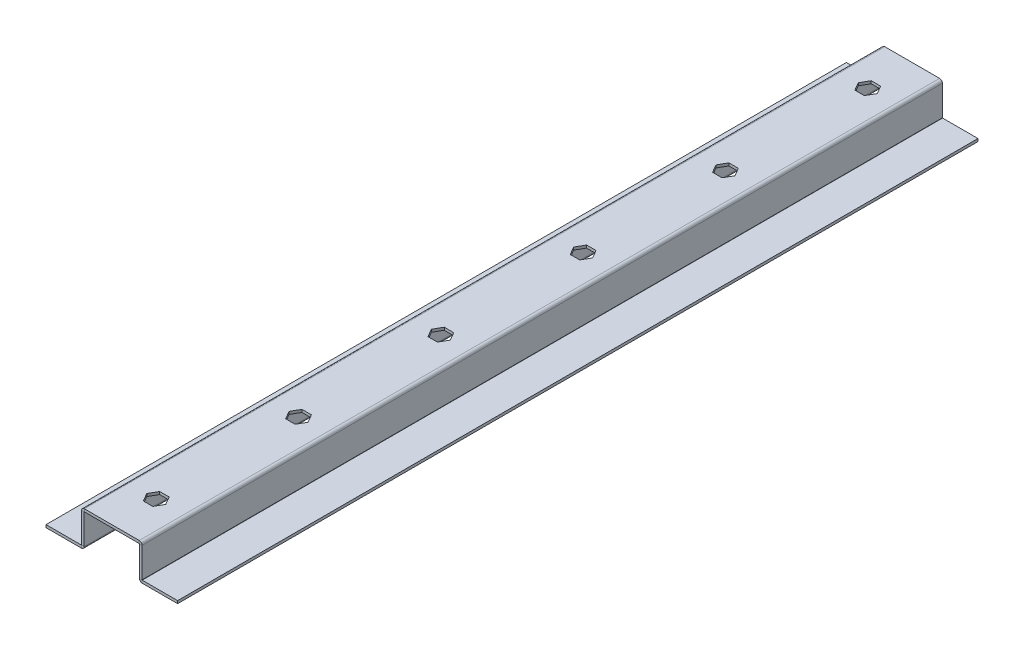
ISO-10303-21;
HEADER;
FILE_DESCRIPTION(('STEP AP214'),'2;1');
FILE_NAME('part.step','',(''),(''),'','','');
FILE_SCHEMA(('AUTOMOTIVE_DESIGN { 1 0 10303 214 1 1 1 1 }'));
ENDSEC;
DATA;
#1=APPLICATION_CONTEXT('core data for automotive mechanical design processes');
#2=APPLICATION_PROTOCOL_DEFINITION('international standard','automotive_design',2000,#1);
#3=PRODUCT_CONTEXT('',#1,'mechanical');
#4=PRODUCT('Part','Part','',(#3));
#5=PRODUCT_RELATED_PRODUCT_CATEGORY('part','',(#4));
#6=PRODUCT_DEFINITION_FORMATION('','',#4);
#7=PRODUCT_DEFINITION_CONTEXT('part definition',#1,'design');
#8=PRODUCT_DEFINITION('design','',#6,#7);
#9=PRODUCT_DEFINITION_SHAPE('','',#8);
#10=(LENGTH_UNIT() NAMED_UNIT(*) SI_UNIT(.MILLI.,.METRE.));
#11=(NAMED_UNIT(*) PLANE_ANGLE_UNIT() SI_UNIT($,.RADIAN.));
#12=(NAMED_UNIT(*) SI_UNIT($,.STERADIAN.) SOLID_ANGLE_UNIT());
#13=UNCERTAINTY_MEASURE_WITH_UNIT(LENGTH_MEASURE(1.E-05),#10,'distance_accuracy_value','');
#14=(GEOMETRIC_REPRESENTATION_CONTEXT(3) GLOBAL_UNCERTAINTY_ASSIGNED_CONTEXT((#13)) GLOBAL_UNIT_ASSIGNED_CONTEXT((#10,
#11,#12)) REPRESENTATION_CONTEXT('',''));
#15=CARTESIAN_POINT('',(0.,0.,0.));
#16=DIRECTION('',(0.,0.,1.));
#17=DIRECTION('',(1.,0.,0.));
#18=AXIS2_PLACEMENT_3D('',#15,#16,#17);
#19=CARTESIAN_POINT('',(17.1,-18.5,225.));
#20=DIRECTION('',(0.,0.,1.));
#21=DIRECTION('',(1.,0.,0.));
#22=AXIS2_PLACEMENT_3D('',#19,#20,#21);
#23=PLANE('',#22);
#24=DIRECTION('',(0.,-1.,0.));
#25=VECTOR('',#24,1.);
#26=CARTESIAN_POINT('',(17.1,-18.5,225.));
#27=LINE('',#26,#25);
#28=CARTESIAN_POINT('',(17.1,-18.5,225.));
#29=VERTEX_POINT('',#28);
#30=CARTESIAN_POINT('',(17.1,-20.,225.));
#31=VERTEX_POINT('',#30);
#32=EDGE_CURVE('E800',#29,#31,#27,.T.);
#33=ORIENTED_EDGE('',*,*,#32,.F.);
#34=CARTESIAN_POINT('',(17.1,-18.4,225.));
#35=DIRECTION('',(0.,0.,1.));
#36=DIRECTION('',(1.,0.,0.));
#37=AXIS2_PLACEMENT_3D('',#34,#35,#36);
#38=CIRCLE('',#37,0.1);
#39=CARTESIAN_POINT('',(17.,-18.4,225.));
#40=VERTEX_POINT('',#39);
#41=EDGE_CURVE('E635',#29,#40,#38,.F.);
#42=ORIENTED_EDGE('',*,*,#41,.T.);
#43=DIRECTION('',(1.,0.,0.));
#44=VECTOR('',#43,1.);
#45=CARTESIAN_POINT('',(15.5,-18.4,225.));
#46=LINE('',#45,#44);
#47=CARTESIAN_POINT('',(15.5,-18.4,225.));
#48=VERTEX_POINT('',#47);
#49=EDGE_CURVE('E798',#48,#40,#46,.T.);
#50=ORIENTED_EDGE('',*,*,#49,.F.);
#51=CARTESIAN_POINT('',(17.1,-18.4,225.));
#52=DIRECTION('',(0.,0.,1.));
#53=DIRECTION('',(1.,0.,0.));
#54=AXIS2_PLACEMENT_3D('',#51,#52,#53);
#55=CIRCLE('',#54,1.6);
#56=EDGE_CURVE('E623',#31,#48,#55,.F.);
#57=ORIENTED_EDGE('',*,*,#56,.F.);
#58=EDGE_LOOP('',(#33,#42,#50,#57));
#59=FACE_BOUND('',#58,.T.);
#60=ADVANCED_FACE('F38',(#59),#23,.T.);
#61=CARTESIAN_POINT('',(15.5,-18.4,225.));
#62=DIRECTION('',(0.,0.,1.));
#63=DIRECTION('',(1.,0.,0.));
#64=AXIS2_PLACEMENT_3D('',#61,#62,#63);
#65=PLANE('',#64);
#66=DIRECTION('',(-1.,0.,0.));
#67=VECTOR('',#66,1.);
#68=CARTESIAN_POINT('',(17.,-18.5,225.));
#69=LINE('',#68,#67);
#70=CARTESIAN_POINT('',(37.,-18.5,225.));
#71=VERTEX_POINT('',#70);
#72=EDGE_CURVE('E632',#71,#29,#69,.T.);
#73=ORIENTED_EDGE('',*,*,#72,.T.);
#74=ORIENTED_EDGE('',*,*,#32,.T.);
#75=DIRECTION('',(-1.,0.,0.));
#76=VECTOR('',#75,1.);
#77=CARTESIAN_POINT('',(17.,-20.,225.));
#78=LINE('',#77,#76);
#79=CARTESIAN_POINT('',(37.,-20.,225.));
#80=VERTEX_POINT('',#79);
#81=EDGE_CURVE('E626',#80,#31,#78,.T.);
#82=ORIENTED_EDGE('',*,*,#81,.F.);
#83=DIRECTION('',(0.,-1.,0.));
#84=VECTOR('',#83,1.);
#85=CARTESIAN_POINT('',(37.,-18.5,225.));
#86=LINE('',#85,#84);
#87=EDGE_CURVE('E629',#71,#80,#86,.T.);
#88=ORIENTED_EDGE('',*,*,#87,.F.);
#89=EDGE_LOOP('',(#73,#74,#82,#88));
#90=FACE_BOUND('',#89,.T.);
#91=ADVANCED_FACE('F917',(#90),#65,.T.);
#92=CARTESIAN_POINT('',(17.,-18.4,-225.));
#93=DIRECTION('',(0.,0.,-1.));
#94=DIRECTION('',(-1.,0.,0.));
#95=AXIS2_PLACEMENT_3D('',#92,#93,#94);
#96=PLANE('',#95);
#97=DIRECTION('',(-1.,0.,0.));
#98=VECTOR('',#97,1.);
#99=CARTESIAN_POINT('',(17.,-18.4,-225.));
#100=LINE('',#99,#98);
#101=CARTESIAN_POINT('',(17.,-18.4,-225.));
#102=VERTEX_POINT('',#101);
#103=CARTESIAN_POINT('',(15.5,-18.4,-225.));
#104=VERTEX_POINT('',#103);
#105=EDGE_CURVE('E796',#102,#104,#100,.T.);
#106=ORIENTED_EDGE('',*,*,#105,.F.);
#107=CARTESIAN_POINT('',(17.1,-18.4,-225.));
#108=DIRECTION('',(0.,0.,1.));
#109=DIRECTION('',(1.,0.,0.));
#110=AXIS2_PLACEMENT_3D('',#107,#108,#109);
#111=CIRCLE('',#110,0.1);
#112=CARTESIAN_POINT('',(17.1,-18.5,-225.));
#113=VERTEX_POINT('',#112);
#114=EDGE_CURVE('E695',#113,#102,#111,.F.);
#115=ORIENTED_EDGE('',*,*,#114,.F.);
#116=DIRECTION('',(0.,1.,0.));
#117=VECTOR('',#116,1.);
#118=CARTESIAN_POINT('',(17.1,-20.,-225.));
#119=LINE('',#118,#117);
#120=CARTESIAN_POINT('',(17.1,-20.,-225.));
#121=VERTEX_POINT('',#120);
#122=EDGE_CURVE('E794',#121,#113,#119,.T.);
#123=ORIENTED_EDGE('',*,*,#122,.F.);
#124=CARTESIAN_POINT('',(17.1,-18.4,-225.));
#125=DIRECTION('',(0.,0.,1.));
#126=DIRECTION('',(1.,0.,0.));
#127=AXIS2_PLACEMENT_3D('',#124,#125,#126);
#128=CIRCLE('',#127,1.6);
#129=EDGE_CURVE('E683',#121,#104,#128,.F.);
#130=ORIENTED_EDGE('',*,*,#129,.T.);
#131=EDGE_LOOP('',(#106,#115,#123,#130));
#132=FACE_BOUND('',#131,.T.);
#133=ADVANCED_FACE('F923',(#132),#96,.T.);
#134=CARTESIAN_POINT('',(17.1,-20.,-225.));
#135=DIRECTION('',(0.,0.,-1.));
#136=DIRECTION('',(-1.,0.,0.));
#137=AXIS2_PLACEMENT_3D('',#134,#135,#136);
#138=PLANE('',#137);
#139=DIRECTION('',(0.,1.,0.));
#140=VECTOR('',#139,1.);
#141=CARTESIAN_POINT('',(17.,0.,-225.));
#142=LINE('',#141,#140);
#143=CARTESIAN_POINT('',(17.,-1.6,-225.));
#144=VERTEX_POINT('',#143);
#145=EDGE_CURVE('E698',#102,#144,#142,.T.);
#146=ORIENTED_EDGE('',*,*,#145,.F.);
#147=ORIENTED_EDGE('',*,*,#105,.T.);
#148=DIRECTION('',(0.,1.,0.));
#149=VECTOR('',#148,1.);
#150=CARTESIAN_POINT('',(15.5,0.,-225.));
#151=LINE('',#150,#149);
#152=CARTESIAN_POINT('',(15.5,-1.6,-225.));
#153=VERTEX_POINT('',#152);
#154=EDGE_CURVE('E680',#104,#153,#151,.T.);
#155=ORIENTED_EDGE('',*,*,#154,.T.);
#156=DIRECTION('',(1.,0.,0.));
#157=VECTOR('',#156,1.);
#158=CARTESIAN_POINT('',(15.5,-1.6,-225.));
#159=LINE('',#158,#157);
#160=EDGE_CURVE('E786',#153,#144,#159,.T.);
#161=ORIENTED_EDGE('',*,*,#160,.T.);
#162=EDGE_LOOP('',(#146,#147,#155,#161));
#163=FACE_BOUND('',#162,.T.);
#164=ADVANCED_FACE('F1661',(#163),#138,.T.);
#165=CARTESIAN_POINT('',(17.,-1.6,225.));
#166=DIRECTION('',(0.,0.,1.));
#167=DIRECTION('',(1.,0.,0.));
#168=AXIS2_PLACEMENT_3D('',#165,#166,#167);
#169=PLANE('',#168);
#170=DIRECTION('',(-1.,0.,0.));
#171=VECTOR('',#170,1.);
#172=CARTESIAN_POINT('',(17.,-1.6,225.));
#173=LINE('',#172,#171);
#174=CARTESIAN_POINT('',(17.,-1.6,225.));
#175=VERTEX_POINT('',#174);
#176=CARTESIAN_POINT('',(15.5,-1.6,225.));
#177=VERTEX_POINT('',#176);
#178=EDGE_CURVE('E792',#175,#177,#173,.T.);
#179=ORIENTED_EDGE('',*,*,#178,.F.);
#180=CARTESIAN_POINT('',(15.4,-1.6,225.));
#181=DIRECTION('',(0.,0.,-1.));
#182=DIRECTION('',(-1.,0.,0.));
#183=AXIS2_PLACEMENT_3D('',#180,#181,#182);
#184=CIRCLE('',#183,1.6);
#185=CARTESIAN_POINT('',(15.4,0.,225.));
#186=VERTEX_POINT('',#185);
#187=EDGE_CURVE('E641',#175,#186,#184,.F.);
#188=ORIENTED_EDGE('',*,*,#187,.T.);
#189=DIRECTION('',(0.,1.,0.));
#190=VECTOR('',#189,1.);
#191=CARTESIAN_POINT('',(15.4,-1.5,225.));
#192=LINE('',#191,#190);
#193=CARTESIAN_POINT('',(15.4,-1.5,225.));
#194=VERTEX_POINT('',#193);
#195=EDGE_CURVE('E790',#194,#186,#192,.T.);
#196=ORIENTED_EDGE('',*,*,#195,.F.);
#197=CARTESIAN_POINT('',(15.4,-1.6,225.));
#198=DIRECTION('',(0.,0.,1.));
#199=DIRECTION('',(1.,0.,0.));
#200=AXIS2_PLACEMENT_3D('',#197,#198,#199);
#201=CIRCLE('',#200,0.1);
#202=EDGE_CURVE('E617',#177,#194,#201,.T.);
#203=ORIENTED_EDGE('',*,*,#202,.F.);
#204=EDGE_LOOP('',(#179,#188,#196,#203));
#205=FACE_BOUND('',#204,.T.);
#206=ADVANCED_FACE('F1650',(#205),#169,.T.);
#207=CARTESIAN_POINT('',(15.4,-1.5,225.));
#208=DIRECTION('',(0.,0.,1.));
#209=DIRECTION('',(1.,0.,0.));
#210=AXIS2_PLACEMENT_3D('',#207,#208,#209);
#211=PLANE('',#210);
#212=DIRECTION('',(0.,1.,0.));
#213=VECTOR('',#212,1.);
#214=CARTESIAN_POINT('',(17.,0.,225.));
#215=LINE('',#214,#213);
#216=EDGE_CURVE('E638',#40,#175,#215,.T.);
#217=ORIENTED_EDGE('',*,*,#216,.T.);
#218=ORIENTED_EDGE('',*,*,#178,.T.);
#219=DIRECTION('',(0.,1.,0.));
#220=VECTOR('',#219,1.);
#221=CARTESIAN_POINT('',(15.5,0.,225.));
#222=LINE('',#221,#220);
#223=EDGE_CURVE('E620',#48,#177,#222,.T.);
#224=ORIENTED_EDGE('',*,*,#223,.F.);
#225=ORIENTED_EDGE('',*,*,#49,.T.);
#226=EDGE_LOOP('',(#217,#218,#224,#225));
#227=FACE_BOUND('',#226,.T.);
#228=ADVANCED_FACE('F1639',(#227),#211,.T.);
#229=CARTESIAN_POINT('',(15.4,0.,-225.));
#230=DIRECTION('',(0.,0.,-1.));
#231=DIRECTION('',(-1.,0.,0.));
#232=AXIS2_PLACEMENT_3D('',#229,#230,#231);
#233=PLANE('',#232);
#234=DIRECTION('',(0.,-1.,0.));
#235=VECTOR('',#234,1.);
#236=CARTESIAN_POINT('',(15.4,0.,-225.));
#237=LINE('',#236,#235);
#238=CARTESIAN_POINT('',(15.4,0.,-225.));
#239=VERTEX_POINT('',#238);
#240=CARTESIAN_POINT('',(15.4,-1.5,-225.));
#241=VERTEX_POINT('',#240);
#242=EDGE_CURVE('E788',#239,#241,#237,.T.);
#243=ORIENTED_EDGE('',*,*,#242,.F.);
#244=CARTESIAN_POINT('',(15.4,-1.6,-225.));
#245=DIRECTION('',(0.,0.,-1.));
#246=DIRECTION('',(-1.,0.,0.));
#247=AXIS2_PLACEMENT_3D('',#244,#245,#246);
#248=CIRCLE('',#247,1.6);
#249=EDGE_CURVE('E701',#144,#239,#248,.F.);
#250=ORIENTED_EDGE('',*,*,#249,.F.);
#251=ORIENTED_EDGE('',*,*,#160,.F.);
#252=CARTESIAN_POINT('',(15.4,-1.6,-225.));
#253=DIRECTION('',(0.,0.,1.));
#254=DIRECTION('',(1.,0.,0.));
#255=AXIS2_PLACEMENT_3D('',#252,#253,#254);
#256=CIRCLE('',#255,0.1);
#257=EDGE_CURVE('E677',#153,#241,#256,.T.);
#258=ORIENTED_EDGE('',*,*,#257,.T.);
#259=EDGE_LOOP('',(#243,#250,#251,#258));
#260=FACE_BOUND('',#259,.T.);
#261=ADVANCED_FACE('F1628',(#260),#233,.T.);
#262=CARTESIAN_POINT('',(15.5,-1.6,-225.));
#263=DIRECTION('',(0.,0.,-1.));
#264=DIRECTION('',(-1.,0.,0.));
#265=AXIS2_PLACEMENT_3D('',#262,#263,#264);
#266=PLANE('',#265);
#267=DIRECTION('',(-1.,0.,0.));
#268=VECTOR('',#267,1.);
#269=CARTESIAN_POINT('',(-17.,0.,-225.));
#270=LINE('',#269,#268);
#271=CARTESIAN_POINT('',(-15.4,0.,-225.));
#272=VERTEX_POINT('',#271);
#273=EDGE_CURVE('E704',#239,#272,#270,.T.);
#274=ORIENTED_EDGE('',*,*,#273,.F.);
#275=ORIENTED_EDGE('',*,*,#242,.T.);
#276=DIRECTION('',(1.,0.,0.));
#277=VECTOR('',#276,1.);
#278=CARTESIAN_POINT('',(-17.,-1.5,-225.));
#279=LINE('',#278,#277);
#280=CARTESIAN_POINT('',(-15.4,-1.5,-225.));
#281=VERTEX_POINT('',#280);
#282=EDGE_CURVE('E674',#241,#281,#279,.F.);
#283=ORIENTED_EDGE('',*,*,#282,.T.);
#284=DIRECTION('',(0.,1.,0.));
#285=VECTOR('',#284,1.);
#286=CARTESIAN_POINT('',(-15.4,-1.5,-225.));
#287=LINE('',#286,#285);
#288=EDGE_CURVE('E778',#281,#272,#287,.T.);
#289=ORIENTED_EDGE('',*,*,#288,.T.);
#290=EDGE_LOOP('',(#274,#275,#283,#289));
#291=FACE_BOUND('',#290,.T.);
#292=ADVANCED_FACE('F1617',(#291),#266,.T.);
#293=CARTESIAN_POINT('',(-15.4,0.,225.));
#294=DIRECTION('',(0.,0.,1.));
#295=DIRECTION('',(1.,0.,0.));
#296=AXIS2_PLACEMENT_3D('',#293,#294,#295);
#297=PLANE('',#296);
#298=DIRECTION('',(0.,-1.,0.));
#299=VECTOR('',#298,1.);
#300=CARTESIAN_POINT('',(-15.4,0.,225.));
#301=LINE('',#300,#299);
#302=CARTESIAN_POINT('',(-15.4,0.,225.));
#303=VERTEX_POINT('',#302);
#304=CARTESIAN_POINT('',(-15.4,-1.5,225.));
#305=VERTEX_POINT('',#304);
#306=EDGE_CURVE('E784',#303,#305,#301,.T.);
#307=ORIENTED_EDGE('',*,*,#306,.F.);
#308=CARTESIAN_POINT('',(-15.4,-1.6,225.));
#309=DIRECTION('',(0.,0.,-1.));
#310=DIRECTION('',(-1.,0.,0.));
#311=AXIS2_PLACEMENT_3D('',#308,#309,#310);
#312=CIRCLE('',#311,1.6);
#313=CARTESIAN_POINT('',(-17.,-1.6,225.));
#314=VERTEX_POINT('',#313);
#315=EDGE_CURVE('E647',#303,#314,#312,.F.);
#316=ORIENTED_EDGE('',*,*,#315,.T.);
#317=DIRECTION('',(-1.,0.,0.));
#318=VECTOR('',#317,1.);
#319=CARTESIAN_POINT('',(-15.5,-1.6,225.));
#320=LINE('',#319,#318);
#321=CARTESIAN_POINT('',(-15.5,-1.6,225.));
#322=VERTEX_POINT('',#321);
#323=EDGE_CURVE('E782',#322,#314,#320,.T.);
#324=ORIENTED_EDGE('',*,*,#323,.F.);
#325=CARTESIAN_POINT('',(-15.4,-1.6,225.));
#326=DIRECTION('',(0.,0.,1.));
#327=DIRECTION('',(1.,0.,0.));
#328=AXIS2_PLACEMENT_3D('',#325,#326,#327);
#329=CIRCLE('',#328,0.1);
#330=EDGE_CURVE('E611',#305,#322,#329,.T.);
#331=ORIENTED_EDGE('',*,*,#330,.F.);
#332=EDGE_LOOP('',(#307,#316,#324,#331));
#333=FACE_BOUND('',#332,.T.);
#334=ADVANCED_FACE('F1606',(#333),#297,.T.);
#335=CARTESIAN_POINT('',(-15.5,-1.6,225.));
#336=DIRECTION('',(0.,0.,1.));
#337=DIRECTION('',(1.,0.,0.));
#338=AXIS2_PLACEMENT_3D('',#335,#336,#337);
#339=PLANE('',#338);
#340=DIRECTION('',(-1.,0.,0.));
#341=VECTOR('',#340,1.);
#342=CARTESIAN_POINT('',(-17.,0.,225.));
#343=LINE('',#342,#341);
#344=EDGE_CURVE('E644',#186,#303,#343,.T.);
#345=ORIENTED_EDGE('',*,*,#344,.T.);
#346=ORIENTED_EDGE('',*,*,#306,.T.);
#347=DIRECTION('',(1.,0.,0.));
#348=VECTOR('',#347,1.);
#349=CARTESIAN_POINT('',(-17.,-1.5,225.));
#350=LINE('',#349,#348);
#351=EDGE_CURVE('E614',#194,#305,#350,.F.);
#352=ORIENTED_EDGE('',*,*,#351,.F.);
#353=ORIENTED_EDGE('',*,*,#195,.T.);
#354=EDGE_LOOP('',(#345,#346,#352,#353));
#355=FACE_BOUND('',#354,.T.);
#356=ADVANCED_FACE('F1595',(#355),#339,.T.);
#357=CARTESIAN_POINT('',(-17.,-1.6,-225.));
#358=DIRECTION('',(0.,0.,-1.));
#359=DIRECTION('',(-1.,0.,0.));
#360=AXIS2_PLACEMENT_3D('',#357,#358,#359);
#361=PLANE('',#360);
#362=DIRECTION('',(1.,0.,0.));
#363=VECTOR('',#362,1.);
#364=CARTESIAN_POINT('',(-17.,-1.6,-225.));
#365=LINE('',#364,#363);
#366=CARTESIAN_POINT('',(-17.,-1.6,-225.));
#367=VERTEX_POINT('',#366);
#368=CARTESIAN_POINT('',(-15.5,-1.6,-225.));
#369=VERTEX_POINT('',#368);
#370=EDGE_CURVE('E780',#367,#369,#365,.T.);
#371=ORIENTED_EDGE('',*,*,#370,.F.);
#372=CARTESIAN_POINT('',(-15.4,-1.6,-225.));
#373=DIRECTION('',(0.,0.,-1.));
#374=DIRECTION('',(-1.,0.,0.));
#375=AXIS2_PLACEMENT_3D('',#372,#373,#374);
#376=CIRCLE('',#375,1.6);
#377=EDGE_CURVE('E707',#272,#367,#376,.F.);
#378=ORIENTED_EDGE('',*,*,#377,.F.);
#379=ORIENTED_EDGE('',*,*,#288,.F.);
#380=CARTESIAN_POINT('',(-15.4,-1.6,-225.));
#381=DIRECTION('',(0.,0.,1.));
#382=DIRECTION('',(1.,0.,0.));
#383=AXIS2_PLACEMENT_3D('',#380,#381,#382);
#384=CIRCLE('',#383,0.1);
#385=EDGE_CURVE('E671',#281,#369,#384,.T.);
#386=ORIENTED_EDGE('',*,*,#385,.T.);
#387=EDGE_LOOP('',(#371,#378,#379,#386));
#388=FACE_BOUND('',#387,.T.);
#389=ADVANCED_FACE('F1584',(#388),#361,.T.);
#390=CARTESIAN_POINT('',(-15.4,-1.5,-225.));
#391=DIRECTION('',(0.,0.,-1.));
#392=DIRECTION('',(-1.,0.,0.));
#393=AXIS2_PLACEMENT_3D('',#390,#391,#392);
#394=PLANE('',#393);
#395=DIRECTION('',(0.,-1.,0.));
#396=VECTOR('',#395,1.);
#397=CARTESIAN_POINT('',(-17.,0.,-225.));
#398=LINE('',#397,#396);
#399=CARTESIAN_POINT('',(-17.,-18.4,-225.));
#400=VERTEX_POINT('',#399);
#401=EDGE_CURVE('E710',#367,#400,#398,.T.);
#402=ORIENTED_EDGE('',*,*,#401,.F.);
#403=ORIENTED_EDGE('',*,*,#370,.T.);
#404=DIRECTION('',(0.,-1.,0.));
#405=VECTOR('',#404,1.);
#406=CARTESIAN_POINT('',(-15.5,0.,-225.));
#407=LINE('',#406,#405);
#408=CARTESIAN_POINT('',(-15.5,-18.4,-225.));
#409=VERTEX_POINT('',#408);
#410=EDGE_CURVE('E668',#369,#409,#407,.T.);
#411=ORIENTED_EDGE('',*,*,#410,.T.);
#412=DIRECTION('',(-1.,0.,0.));
#413=VECTOR('',#412,1.);
#414=CARTESIAN_POINT('',(-15.5,-18.4,-225.));
#415=LINE('',#414,#413);
#416=EDGE_CURVE('E770',#409,#400,#415,.T.);
#417=ORIENTED_EDGE('',*,*,#416,.T.);
#418=EDGE_LOOP('',(#402,#403,#411,#417));
#419=FACE_BOUND('',#418,.T.);
#420=ADVANCED_FACE('F1573',(#419),#394,.T.);
#421=CARTESIAN_POINT('',(-17.,-18.4,225.));
#422=DIRECTION('',(0.,0.,1.));
#423=DIRECTION('',(1.,0.,0.));
#424=AXIS2_PLACEMENT_3D('',#421,#422,#423);
#425=PLANE('',#424);
#426=DIRECTION('',(1.,0.,0.));
#427=VECTOR('',#426,1.);
#428=CARTESIAN_POINT('',(-17.,-18.4,225.));
#429=LINE('',#428,#427);
#430=CARTESIAN_POINT('',(-17.,-18.4,225.));
#431=VERTEX_POINT('',#430);
#432=CARTESIAN_POINT('',(-15.5,-18.4,225.));
#433=VERTEX_POINT('',#432);
#434=EDGE_CURVE('E776',#431,#433,#429,.T.);
#435=ORIENTED_EDGE('',*,*,#434,.F.);
#436=CARTESIAN_POINT('',(-17.1,-18.4,225.));
#437=DIRECTION('',(0.,0.,1.));
#438=DIRECTION('',(1.,0.,0.));
#439=AXIS2_PLACEMENT_3D('',#436,#437,#438);
#440=CIRCLE('',#439,0.1);
#441=CARTESIAN_POINT('',(-17.1,-18.5,225.));
#442=VERTEX_POINT('',#441);
#443=EDGE_CURVE('E653',#431,#442,#440,.F.);
#444=ORIENTED_EDGE('',*,*,#443,.T.);
#445=DIRECTION('',(0.,1.,0.));
#446=VECTOR('',#445,1.);
#447=CARTESIAN_POINT('',(-17.1,-20.,225.));
#448=LINE('',#447,#446);
#449=CARTESIAN_POINT('',(-17.1,-20.,225.));
#450=VERTEX_POINT('',#449);
#451=EDGE_CURVE('E774',#450,#442,#448,.T.);
#452=ORIENTED_EDGE('',*,*,#451,.F.);
#453=CARTESIAN_POINT('',(-17.1,-18.4,225.));
#454=DIRECTION('',(0.,0.,1.));
#455=DIRECTION('',(1.,0.,0.));
#456=AXIS2_PLACEMENT_3D('',#453,#454,#455);
#457=CIRCLE('',#456,1.6);
#458=EDGE_CURVE('E605',#433,#450,#457,.F.);
#459=ORIENTED_EDGE('',*,*,#458,.F.);
#460=EDGE_LOOP('',(#435,#444,#452,#459));
#461=FACE_BOUND('',#460,.T.);
#462=ADVANCED_FACE('F1562',(#461),#425,.T.);
#463=CARTESIAN_POINT('',(-17.1,-20.,225.));
#464=DIRECTION('',(0.,0.,1.));
#465=DIRECTION('',(1.,0.,0.));
#466=AXIS2_PLACEMENT_3D('',#463,#464,#465);
#467=PLANE('',#466);
#468=DIRECTION('',(0.,-1.,0.));
#469=VECTOR('',#468,1.);
#470=CARTESIAN_POINT('',(-17.,0.,225.));
#471=LINE('',#470,#469);
#472=EDGE_CURVE('E650',#314,#431,#471,.T.);
#473=ORIENTED_EDGE('',*,*,#472,.T.);
#474=ORIENTED_EDGE('',*,*,#434,.T.);
#475=DIRECTION('',(0.,-1.,0.));
#476=VECTOR('',#475,1.);
#477=CARTESIAN_POINT('',(-15.5,0.,225.));
#478=LINE('',#477,#476);
#479=EDGE_CURVE('E608',#322,#433,#478,.T.);
#480=ORIENTED_EDGE('',*,*,#479,.F.);
#481=ORIENTED_EDGE('',*,*,#323,.T.);
#482=EDGE_LOOP('',(#473,#474,#480,#481));
#483=FACE_BOUND('',#482,.T.);
#484=ADVANCED_FACE('F1551',(#483),#467,.T.);
#485=CARTESIAN_POINT('',(-17.1,-18.5,-225.));
#486=DIRECTION('',(0.,0.,-1.));
#487=DIRECTION('',(-1.,0.,0.));
#488=AXIS2_PLACEMENT_3D('',#485,#486,#487);
#489=PLANE('',#488);
#490=DIRECTION('',(0.,-1.,0.));
#491=VECTOR('',#490,1.);
#492=CARTESIAN_POINT('',(-17.1,-18.5,-225.));
#493=LINE('',#492,#491);
#494=CARTESIAN_POINT('',(-17.1,-18.5,-225.));
#495=VERTEX_POINT('',#494);
#496=CARTESIAN_POINT('',(-17.1,-20.,-225.));
#497=VERTEX_POINT('',#496);
#498=EDGE_CURVE('E772',#495,#497,#493,.T.);
#499=ORIENTED_EDGE('',*,*,#498,.F.);
#500=CARTESIAN_POINT('',(-17.1,-18.4,-225.));
#501=DIRECTION('',(0.,0.,1.));
#502=DIRECTION('',(1.,0.,0.));
#503=AXIS2_PLACEMENT_3D('',#500,#501,#502);
#504=CIRCLE('',#503,0.1);
#505=EDGE_CURVE('E599',#400,#495,#504,.F.);
#506=ORIENTED_EDGE('',*,*,#505,.F.);
#507=ORIENTED_EDGE('',*,*,#416,.F.);
#508=CARTESIAN_POINT('',(-17.1,-18.4,-225.));
#509=DIRECTION('',(0.,0.,1.));
#510=DIRECTION('',(1.,0.,0.));
#511=AXIS2_PLACEMENT_3D('',#508,#509,#510);
#512=CIRCLE('',#511,1.6);
#513=EDGE_CURVE('E665',#409,#497,#512,.F.);
#514=ORIENTED_EDGE('',*,*,#513,.T.);
#515=EDGE_LOOP('',(#499,#506,#507,#514));
#516=FACE_BOUND('',#515,.T.);
#517=ADVANCED_FACE('F1540',(#516),#489,.T.);
#518=CARTESIAN_POINT('',(-15.5,-18.4,-225.));
#519=DIRECTION('',(0.,0.,-1.));
#520=DIRECTION('',(-1.,0.,0.));
#521=AXIS2_PLACEMENT_3D('',#518,#519,#520);
#522=PLANE('',#521);
#523=DIRECTION('',(-1.,0.,0.));
#524=VECTOR('',#523,1.);
#525=CARTESIAN_POINT('',(-17.,-18.5,-225.));
#526=LINE('',#525,#524);
#527=CARTESIAN_POINT('',(-37.,-18.5,-225.));
#528=VERTEX_POINT('',#527);
#529=EDGE_CURVE('E595',#495,#528,#526,.T.);
#530=ORIENTED_EDGE('',*,*,#529,.F.);
#531=ORIENTED_EDGE('',*,*,#498,.T.);
#532=DIRECTION('',(1.,0.,0.));
#533=VECTOR('',#532,1.);
#534=CARTESIAN_POINT('',(-17.,-20.,-225.));
#535=LINE('',#534,#533);
#536=CARTESIAN_POINT('',(-37.,-20.,-225.));
#537=VERTEX_POINT('',#536);
#538=EDGE_CURVE('E662',#497,#537,#535,.F.);
#539=ORIENTED_EDGE('',*,*,#538,.T.);
#540=DIRECTION('',(0.,1.,0.));
#541=VECTOR('',#540,1.);
#542=CARTESIAN_POINT('',(-37.,-20.,-225.));
#543=LINE('',#542,#541);
#544=EDGE_CURVE('E659',#537,#528,#543,.T.);
#545=ORIENTED_EDGE('',*,*,#544,.T.);
#546=EDGE_LOOP('',(#530,#531,#539,#545));
#547=FACE_BOUND('',#546,.T.);
#548=ADVANCED_FACE('F1529',(#547),#522,.T.);
#549=CARTESIAN_POINT('',(-17.,-18.5,225.));
#550=DIRECTION('',(0.,-1.,0.));
#551=DIRECTION('',(0.,0.,-1.));
#552=AXIS2_PLACEMENT_3D('',#549,#550,#551);
#553=PLANE('',#552);
#554=ORIENTED_EDGE('',*,*,#529,.T.);
#555=DIRECTION('',(0.,0.,-1.));
#556=VECTOR('',#555,1.);
#557=CARTESIAN_POINT('',(-37.,-18.5,225.));
#558=LINE('',#557,#556);
#559=CARTESIAN_POINT('',(-37.,-18.5,225.));
#560=VERTEX_POINT('',#559);
#561=EDGE_CURVE('E768',#560,#528,#558,.T.);
#562=ORIENTED_EDGE('',*,*,#561,.F.);
#563=DIRECTION('',(-1.,0.,0.));
#564=VECTOR('',#563,1.);
#565=CARTESIAN_POINT('',(-17.,-18.5,225.));
#566=LINE('',#565,#564);
#567=EDGE_CURVE('E596',#442,#560,#566,.T.);
#568=ORIENTED_EDGE('',*,*,#567,.F.);
#569=DIRECTION('',(0.,0.,-1.));
#570=VECTOR('',#569,1.);
#571=CARTESIAN_POINT('',(-17.1,-18.5,225.));
#572=LINE('',#571,#570);
#573=EDGE_CURVE('E656',#442,#495,#572,.T.);
#574=ORIENTED_EDGE('',*,*,#573,.T.);
#575=EDGE_LOOP('',(#554,#562,#568,#574));
#576=FACE_BOUND('',#575,.T.);
#577=ADVANCED_FACE('F1518',(#576),#553,.F.);
#578=CARTESIAN_POINT('',(-37.,-20.,225.));
#579=DIRECTION('',(-1.,0.,0.));
#580=DIRECTION('',(0.,0.,1.));
#581=AXIS2_PLACEMENT_3D('',#578,#579,#580);
#582=PLANE('',#581);
#583=ORIENTED_EDGE('',*,*,#544,.F.);
#584=DIRECTION('',(0.,0.,-1.));
#585=VECTOR('',#584,1.);
#586=CARTESIAN_POINT('',(-37.,-20.,225.));
#587=LINE('',#586,#585);
#588=CARTESIAN_POINT('',(-37.,-20.,225.));
#589=VERTEX_POINT('',#588);
#590=EDGE_CURVE('E766',#589,#537,#587,.T.);
#591=ORIENTED_EDGE('',*,*,#590,.F.);
#592=DIRECTION('',(0.,1.,0.));
#593=VECTOR('',#592,1.);
#594=CARTESIAN_POINT('',(-37.,-20.,225.));
#595=LINE('',#594,#593);
#596=EDGE_CURVE('E598',#589,#560,#595,.T.);
#597=ORIENTED_EDGE('',*,*,#596,.T.);
#598=ORIENTED_EDGE('',*,*,#561,.T.);
#599=EDGE_LOOP('',(#583,#591,#597,#598));
#600=FACE_BOUND('',#599,.T.);
#601=ADVANCED_FACE('F1507',(#600),#582,.T.);
#602=CARTESIAN_POINT('',(-17.,-20.,225.));
#603=DIRECTION('',(0.,-1.,0.));
#604=DIRECTION('',(0.,0.,-1.));
#605=AXIS2_PLACEMENT_3D('',#602,#603,#604);
#606=PLANE('',#605);
#607=ORIENTED_EDGE('',*,*,#538,.F.);
#608=DIRECTION('',(0.,0.,-1.));
#609=VECTOR('',#608,1.);
#610=CARTESIAN_POINT('',(-17.1,-20.,225.));
#611=LINE('',#610,#609);
#612=EDGE_CURVE('E763',#450,#497,#611,.T.);
#613=ORIENTED_EDGE('',*,*,#612,.F.);
#614=DIRECTION('',(1.,0.,0.));
#615=VECTOR('',#614,1.);
#616=CARTESIAN_POINT('',(-17.,-20.,225.));
#617=LINE('',#616,#615);
#618=EDGE_CURVE('E602',#450,#589,#617,.F.);
#619=ORIENTED_EDGE('',*,*,#618,.T.);
#620=ORIENTED_EDGE('',*,*,#590,.T.);
#621=EDGE_LOOP('',(#607,#613,#619,#620));
#622=FACE_BOUND('',#621,.T.);
#623=ADVANCED_FACE('F1496',(#622),#606,.T.);
#624=CARTESIAN_POINT('',(-17.1,-18.4,225.));
#625=DIRECTION('',(0.,0.,-1.));
#626=DIRECTION('',(-1.,0.,0.));
#627=AXIS2_PLACEMENT_3D('',#624,#625,#626);
#628=CYLINDRICAL_SURFACE('',#627,1.6);
#629=ORIENTED_EDGE('',*,*,#513,.F.);
#630=DIRECTION('',(0.,0.,-1.));
#631=VECTOR('',#630,1.);
#632=CARTESIAN_POINT('',(-15.5,-18.4,225.));
#633=LINE('',#632,#631);
#634=EDGE_CURVE('E760',#433,#409,#633,.T.);
#635=ORIENTED_EDGE('',*,*,#634,.F.);
#636=ORIENTED_EDGE('',*,*,#458,.T.);
#637=ORIENTED_EDGE('',*,*,#612,.T.);
#638=EDGE_LOOP('',(#629,#635,#636,#637));
#639=FACE_BOUND('',#638,.T.);
#640=ADVANCED_FACE('F1485',(#639),#628,.T.);
#641=CARTESIAN_POINT('',(-15.5,0.,225.));
#642=DIRECTION('',(1.,0.,0.));
#643=DIRECTION('',(0.,1.,0.));
#644=AXIS2_PLACEMENT_3D('',#641,#642,#643);
#645=PLANE('',#644);
#646=ORIENTED_EDGE('',*,*,#410,.F.);
#647=DIRECTION('',(0.,0.,-1.));
#648=VECTOR('',#647,1.);
#649=CARTESIAN_POINT('',(-15.5,-1.6,225.));
#650=LINE('',#649,#648);
#651=EDGE_CURVE('E757',#322,#369,#650,.T.);
#652=ORIENTED_EDGE('',*,*,#651,.F.);
#653=ORIENTED_EDGE('',*,*,#479,.T.);
#654=ORIENTED_EDGE('',*,*,#634,.T.);
#655=EDGE_LOOP('',(#646,#652,#653,#654));
#656=FACE_BOUND('',#655,.T.);
#657=ADVANCED_FACE('F1474',(#656),#645,.T.);
#658=CARTESIAN_POINT('',(-15.4,-1.6,225.));
#659=DIRECTION('',(0.,0.,-1.));
#660=DIRECTION('',(-1.,0.,0.));
#661=AXIS2_PLACEMENT_3D('',#658,#659,#660);
#662=CYLINDRICAL_SURFACE('',#661,0.1);
#663=ORIENTED_EDGE('',*,*,#385,.F.);
#664=DIRECTION('',(0.,0.,-1.));
#665=VECTOR('',#664,1.);
#666=CARTESIAN_POINT('',(-15.4,-1.5,225.));
#667=LINE('',#666,#665);
#668=EDGE_CURVE('E754',#305,#281,#667,.T.);
#669=ORIENTED_EDGE('',*,*,#668,.F.);
#670=ORIENTED_EDGE('',*,*,#330,.T.);
#671=ORIENTED_EDGE('',*,*,#651,.T.);
#672=EDGE_LOOP('',(#663,#669,#670,#671));
#673=FACE_BOUND('',#672,.T.);
#674=ADVANCED_FACE('F1081',(#673),#662,.F.);
#675=CARTESIAN_POINT('',(-17.,-1.5,225.));
#676=DIRECTION('',(0.,-1.,0.));
#677=DIRECTION('',(0.,0.,-1.));
#678=AXIS2_PLACEMENT_3D('',#675,#676,#677);
#679=PLANE('',#678);
#680=DIRECTION('',(0.5,0.,-0.866025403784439));
#681=VECTOR('',#680,1.);
#682=CARTESIAN_POINT('',(2.65581123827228,-1.5,-115.415));
#683=LINE('',#682,#681);
#684=CARTESIAN_POINT('',(2.65581123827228,-1.5,-115.415));
#685=VERTEX_POINT('',#684);
#686=CARTESIAN_POINT('',(5.31162247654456,-1.5,-120.015));
#687=VERTEX_POINT('',#686);
#688=EDGE_CURVE('E448',#685,#687,#683,.T.);
#689=ORIENTED_EDGE('',*,*,#688,.T.);
#690=DIRECTION('',(-0.5,0.,-0.866025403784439));
#691=VECTOR('',#690,1.);
#692=CARTESIAN_POINT('',(5.31162247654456,-1.5,-120.015));
#693=LINE('',#692,#691);
#694=CARTESIAN_POINT('',(2.65581123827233,-1.5,-124.615));
#695=VERTEX_POINT('',#694);
#696=EDGE_CURVE('E403',#687,#695,#693,.T.);
#697=ORIENTED_EDGE('',*,*,#696,.T.);
#698=DIRECTION('',(-1.,0.,0.));
#699=VECTOR('',#698,1.);
#700=CARTESIAN_POINT('',(2.65581123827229,-1.5,-124.615));
#701=LINE('',#700,#699);
#702=CARTESIAN_POINT('',(-2.65581123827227,-1.5,-124.615));
#703=VERTEX_POINT('',#702);
#704=EDGE_CURVE('E410',#695,#703,#701,.T.);
#705=ORIENTED_EDGE('',*,*,#704,.T.);
#706=DIRECTION('',(-0.5,0.,0.866025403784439));
#707=VECTOR('',#706,1.);
#708=CARTESIAN_POINT('',(-2.65581123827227,-1.5,-124.615));
#709=LINE('',#708,#707);
#710=CARTESIAN_POINT('',(-5.31162247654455,-1.5,-120.015));
#711=VERTEX_POINT('',#710);
#712=EDGE_CURVE('E427',#703,#711,#709,.T.);
#713=ORIENTED_EDGE('',*,*,#712,.T.);
#714=DIRECTION('',(0.5,0.,0.866025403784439));
#715=VECTOR('',#714,1.);
#716=CARTESIAN_POINT('',(-5.31162247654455,-1.5,-120.015));
#717=LINE('',#716,#715);
#718=CARTESIAN_POINT('',(-2.65581123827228,-1.5,-115.415));
#719=VERTEX_POINT('',#718);
#720=EDGE_CURVE('E435',#711,#719,#717,.T.);
#721=ORIENTED_EDGE('',*,*,#720,.T.);
#722=DIRECTION('',(1.,0.,0.));
#723=VECTOR('',#722,1.);
#724=CARTESIAN_POINT('',(-2.65581123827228,-1.5,-115.415));
#725=LINE('',#724,#723);
#726=EDGE_CURVE('E443',#719,#685,#725,.T.);
#727=ORIENTED_EDGE('',*,*,#726,.T.);
#728=EDGE_LOOP('',(#689,#697,#705,#713,#721,#727));
#729=FACE_BOUND('',#728,.T.);
#730=DIRECTION('',(0.5,0.,-0.866025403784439));
#731=VECTOR('',#730,1.);
#732=CARTESIAN_POINT('',(2.65581123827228,-1.5,-35.405));
#733=LINE('',#732,#731);
#734=CARTESIAN_POINT('',(2.65581123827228,-1.5,-35.405));
#735=VERTEX_POINT('',#734);
#736=CARTESIAN_POINT('',(5.31162247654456,-1.5,-40.005));
#737=VERTEX_POINT('',#736);
#738=EDGE_CURVE('E463',#735,#737,#733,.T.);
#739=ORIENTED_EDGE('',*,*,#738,.T.);
#740=DIRECTION('',(-0.5,0.,-0.866025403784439));
#741=VECTOR('',#740,1.);
#742=CARTESIAN_POINT('',(5.31162247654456,-1.5,-40.005));
#743=LINE('',#742,#741);
#744=CARTESIAN_POINT('',(2.6558112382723,-1.5,-44.605));
#745=VERTEX_POINT('',#744);
#746=EDGE_CURVE('E486',#737,#745,#743,.T.);
#747=ORIENTED_EDGE('',*,*,#746,.T.);
#748=DIRECTION('',(-1.,0.,0.));
#749=VECTOR('',#748,1.);
#750=CARTESIAN_POINT('',(2.65581123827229,-1.5,-44.605));
#751=LINE('',#750,#749);
#752=CARTESIAN_POINT('',(-2.65581123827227,-1.5,-44.605));
#753=VERTEX_POINT('',#752);
#754=EDGE_CURVE('E451',#745,#753,#751,.T.);
#755=ORIENTED_EDGE('',*,*,#754,.T.);
#756=DIRECTION('',(-0.5,0.,0.866025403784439));
#757=VECTOR('',#756,1.);
#758=CARTESIAN_POINT('',(-2.65581123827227,-1.5,-44.605));
#759=LINE('',#758,#757);
#760=CARTESIAN_POINT('',(-5.31162247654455,-1.5,-40.005));
#761=VERTEX_POINT('',#760);
#762=EDGE_CURVE('E454',#753,#761,#759,.T.);
#763=ORIENTED_EDGE('',*,*,#762,.T.);
#764=DIRECTION('',(0.5,0.,0.866025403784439));
#765=VECTOR('',#764,1.);
#766=CARTESIAN_POINT('',(-5.31162247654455,-1.5,-40.005));
#767=LINE('',#766,#765);
#768=CARTESIAN_POINT('',(-2.65581123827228,-1.5,-35.405));
#769=VERTEX_POINT('',#768);
#770=EDGE_CURVE('E457',#761,#769,#767,.T.);
#771=ORIENTED_EDGE('',*,*,#770,.T.);
#772=DIRECTION('',(1.,0.,0.));
#773=VECTOR('',#772,1.);
#774=CARTESIAN_POINT('',(-2.65581123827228,-1.5,-35.405));
#775=LINE('',#774,#773);
#776=EDGE_CURVE('E460',#769,#735,#775,.T.);
#777=ORIENTED_EDGE('',*,*,#776,.T.);
#778=EDGE_LOOP('',(#739,#747,#755,#763,#771,#777));
#779=FACE_BOUND('',#778,.T.);
#780=DIRECTION('',(0.5,0.,-0.866025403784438));
#781=VECTOR('',#780,1.);
#782=CARTESIAN_POINT('',(2.65581123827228,-1.5,124.615));
#783=LINE('',#782,#781);
#784=CARTESIAN_POINT('',(2.65581123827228,-1.5,124.615));
#785=VERTEX_POINT('',#784);
#786=CARTESIAN_POINT('',(5.31162247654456,-1.5,120.015));
#787=VERTEX_POINT('',#786);
#788=EDGE_CURVE('E544',#785,#787,#783,.T.);
#789=ORIENTED_EDGE('',*,*,#788,.T.);
#790=DIRECTION('',(-0.5,0.,-0.866025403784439));
#791=VECTOR('',#790,1.);
#792=CARTESIAN_POINT('',(5.31162247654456,-1.5,120.015));
#793=LINE('',#792,#791);
#794=CARTESIAN_POINT('',(2.65581123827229,-1.5,115.415));
#795=VERTEX_POINT('',#794);
#796=EDGE_CURVE('E501',#787,#795,#793,.T.);
#797=ORIENTED_EDGE('',*,*,#796,.T.);
#798=DIRECTION('',(-1.,0.,0.));
#799=VECTOR('',#798,1.);
#800=CARTESIAN_POINT('',(2.65581123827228,-1.5,115.415));
#801=LINE('',#800,#799);
#802=CARTESIAN_POINT('',(-2.65581123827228,-1.5,115.415));
#803=VERTEX_POINT('',#802);
#804=EDGE_CURVE('E515',#795,#803,#801,.T.);
#805=ORIENTED_EDGE('',*,*,#804,.T.);
#806=DIRECTION('',(-0.5,0.,0.866025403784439));
#807=VECTOR('',#806,1.);
#808=CARTESIAN_POINT('',(-2.65581123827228,-1.5,115.415));
#809=LINE('',#808,#807);
#810=CARTESIAN_POINT('',(-5.31162247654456,-1.5,120.015));
#811=VERTEX_POINT('',#810);
#812=EDGE_CURVE('E523',#803,#811,#809,.T.);
#813=ORIENTED_EDGE('',*,*,#812,.T.);
#814=DIRECTION('',(0.5,0.,0.866025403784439));
#815=VECTOR('',#814,1.);
#816=CARTESIAN_POINT('',(-5.31162247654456,-1.5,120.015));
#817=LINE('',#816,#815);
#818=CARTESIAN_POINT('',(-2.65581123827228,-1.5,124.615));
#819=VERTEX_POINT('',#818);
#820=EDGE_CURVE('E531',#811,#819,#817,.T.);
#821=ORIENTED_EDGE('',*,*,#820,.T.);
#822=DIRECTION('',(1.,0.,0.));
#823=VECTOR('',#822,1.);
#824=CARTESIAN_POINT('',(-2.65581123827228,-1.5,124.615));
#825=LINE('',#824,#823);
#826=EDGE_CURVE('E539',#819,#785,#825,.T.);
#827=ORIENTED_EDGE('',*,*,#826,.T.);
#828=EDGE_LOOP('',(#789,#797,#805,#813,#821,#827));
#829=FACE_BOUND('',#828,.T.);
#830=DIRECTION('',(0.5,0.,-0.866025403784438));
#831=VECTOR('',#830,1.);
#832=CARTESIAN_POINT('',(2.65581123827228,-1.5,44.605));
#833=LINE('',#832,#831);
#834=CARTESIAN_POINT('',(2.65581123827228,-1.5,44.605));
#835=VERTEX_POINT('',#834);
#836=CARTESIAN_POINT('',(5.31162247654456,-1.5,40.005));
#837=VERTEX_POINT('',#836);
#838=EDGE_CURVE('E559',#835,#837,#833,.T.);
#839=ORIENTED_EDGE('',*,*,#838,.T.);
#840=DIRECTION('',(-0.5,0.,-0.866025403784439));
#841=VECTOR('',#840,1.);
#842=CARTESIAN_POINT('',(5.31162247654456,-1.5,40.005));
#843=LINE('',#842,#841);
#844=CARTESIAN_POINT('',(2.6558112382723,-1.5,35.405));
#845=VERTEX_POINT('',#844);
#846=EDGE_CURVE('E582',#837,#845,#843,.T.);
#847=ORIENTED_EDGE('',*,*,#846,.T.);
#848=DIRECTION('',(-1.,0.,0.));
#849=VECTOR('',#848,1.);
#850=CARTESIAN_POINT('',(2.65581123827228,-1.5,35.405));
#851=LINE('',#850,#849);
#852=CARTESIAN_POINT('',(-2.65581123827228,-1.5,35.405));
#853=VERTEX_POINT('',#852);
#854=EDGE_CURVE('E547',#845,#853,#851,.T.);
#855=ORIENTED_EDGE('',*,*,#854,.T.);
#856=DIRECTION('',(-0.5,0.,0.866025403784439));
#857=VECTOR('',#856,1.);
#858=CARTESIAN_POINT('',(-2.65581123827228,-1.5,35.405));
#859=LINE('',#858,#857);
#860=CARTESIAN_POINT('',(-5.31162247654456,-1.5,40.005));
#861=VERTEX_POINT('',#860);
#862=EDGE_CURVE('E550',#853,#861,#859,.T.);
#863=ORIENTED_EDGE('',*,*,#862,.T.);
#864=DIRECTION('',(0.5,0.,0.866025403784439));
#865=VECTOR('',#864,1.);
#866=CARTESIAN_POINT('',(-5.31162247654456,-1.5,40.005));
#867=LINE('',#866,#865);
#868=CARTESIAN_POINT('',(-2.65581123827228,-1.5,44.605));
#869=VERTEX_POINT('',#868);
#870=EDGE_CURVE('E553',#861,#869,#867,.T.);
#871=ORIENTED_EDGE('',*,*,#870,.T.);
#872=DIRECTION('',(1.,0.,0.));
#873=VECTOR('',#872,1.);
#874=CARTESIAN_POINT('',(-2.65581123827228,-1.5,44.605));
#875=LINE('',#874,#873);
#876=EDGE_CURVE('E556',#869,#835,#875,.T.);
#877=ORIENTED_EDGE('',*,*,#876,.T.);
#878=EDGE_LOOP('',(#839,#847,#855,#863,#871,#877));
#879=FACE_BOUND('',#878,.T.);
#880=ORIENTED_EDGE('',*,*,#282,.F.);
#881=DIRECTION('',(0.,0.,-1.));
#882=VECTOR('',#881,1.);
#883=CARTESIAN_POINT('',(15.4,-1.5,225.));
#884=LINE('',#883,#882);
#885=EDGE_CURVE('E751',#194,#241,#884,.T.);
#886=ORIENTED_EDGE('',*,*,#885,.F.);
#887=ORIENTED_EDGE('',*,*,#351,.T.);
#888=ORIENTED_EDGE('',*,*,#668,.T.);
#889=EDGE_LOOP('',(#880,#886,#887,#888));
#890=FACE_BOUND('',#889,.T.);
#891=DIRECTION('',(0.5,0.,-0.866025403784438));
#892=VECTOR('',#891,1.);
#893=CARTESIAN_POINT('',(2.65581123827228,-1.5,204.625));
#894=LINE('',#893,#892);
#895=CARTESIAN_POINT('',(2.65581123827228,-1.5,204.625));
#896=VERTEX_POINT('',#895);
#897=CARTESIAN_POINT('',(5.31162247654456,-1.5,200.025));
#898=VERTEX_POINT('',#897);
#899=EDGE_CURVE('E819',#896,#898,#894,.T.);
#900=ORIENTED_EDGE('',*,*,#899,.T.);
#901=DIRECTION('',(-0.5,0.,-0.866025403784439));
#902=VECTOR('',#901,1.);
#903=CARTESIAN_POINT('',(5.31162247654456,-1.5,200.025));
#904=LINE('',#903,#902);
#905=CARTESIAN_POINT('',(2.6558112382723,-1.5,195.425));
#906=VERTEX_POINT('',#905);
#907=EDGE_CURVE('E821',#898,#906,#904,.T.);
#908=ORIENTED_EDGE('',*,*,#907,.T.);
#909=DIRECTION('',(-1.,0.,0.));
#910=VECTOR('',#909,1.);
#911=CARTESIAN_POINT('',(2.65581123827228,-1.5,195.425));
#912=LINE('',#911,#910);
#913=CARTESIAN_POINT('',(-2.65581123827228,-1.5,195.425));
#914=VERTEX_POINT('',#913);
#915=EDGE_CURVE('E823',#906,#914,#912,.T.);
#916=ORIENTED_EDGE('',*,*,#915,.T.);
#917=DIRECTION('',(-0.5,0.,0.866025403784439));
#918=VECTOR('',#917,1.);
#919=CARTESIAN_POINT('',(-2.65581123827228,-1.5,195.425));
#920=LINE('',#919,#918);
#921=CARTESIAN_POINT('',(-5.31162247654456,-1.5,200.025));
#922=VERTEX_POINT('',#921);
#923=EDGE_CURVE('E825',#914,#922,#920,.T.);
#924=ORIENTED_EDGE('',*,*,#923,.T.);
#925=DIRECTION('',(0.5,0.,0.866025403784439));
#926=VECTOR('',#925,1.);
#927=CARTESIAN_POINT('',(-5.31162247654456,-1.5,200.025));
#928=LINE('',#927,#926);
#929=CARTESIAN_POINT('',(-2.65581123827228,-1.5,204.625));
#930=VERTEX_POINT('',#929);
#931=EDGE_CURVE('E827',#922,#930,#928,.T.);
#932=ORIENTED_EDGE('',*,*,#931,.T.);
#933=DIRECTION('',(1.,0.,0.));
#934=VECTOR('',#933,1.);
#935=CARTESIAN_POINT('',(-2.65581123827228,-1.5,204.625));
#936=LINE('',#935,#934);
#937=EDGE_CURVE('E829',#930,#896,#936,.T.);
#938=ORIENTED_EDGE('',*,*,#937,.T.);
#939=EDGE_LOOP('',(#900,#908,#916,#924,#932,#938));
#940=FACE_BOUND('',#939,.T.);
#941=DIRECTION('',(0.5,0.,-0.866025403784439));
#942=VECTOR('',#941,1.);
#943=CARTESIAN_POINT('',(2.65581123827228,-1.5,-195.425));
#944=LINE('',#943,#942);
#945=CARTESIAN_POINT('',(2.65581123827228,-1.5,-195.425));
#946=VERTEX_POINT('',#945);
#947=CARTESIAN_POINT('',(5.31162247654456,-1.5,-200.025));
#948=VERTEX_POINT('',#947);
#949=EDGE_CURVE('E53',#946,#948,#944,.T.);
#950=ORIENTED_EDGE('',*,*,#949,.T.);
#951=DIRECTION('',(-0.5,0.,-0.866025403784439));
#952=VECTOR('',#951,1.);
#953=CARTESIAN_POINT('',(5.31162247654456,-1.5,-200.025));
#954=LINE('',#953,#952);
#955=CARTESIAN_POINT('',(2.6558112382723,-1.5,-204.625));
#956=VERTEX_POINT('',#955);
#957=EDGE_CURVE('E868',#948,#956,#954,.T.);
#958=ORIENTED_EDGE('',*,*,#957,.T.);
#959=DIRECTION('',(-1.,0.,0.));
#960=VECTOR('',#959,1.);
#961=CARTESIAN_POINT('',(2.65581123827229,-1.5,-204.625));
#962=LINE('',#961,#960);
#963=CARTESIAN_POINT('',(-2.65581123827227,-1.5,-204.625));
#964=VERTEX_POINT('',#963);
#965=EDGE_CURVE('E870',#956,#964,#962,.T.);
#966=ORIENTED_EDGE('',*,*,#965,.T.);
#967=DIRECTION('',(-0.5,0.,0.866025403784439));
#968=VECTOR('',#967,1.);
#969=CARTESIAN_POINT('',(-2.65581123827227,-1.5,-204.625));
#970=LINE('',#969,#968);
#971=CARTESIAN_POINT('',(-5.31162247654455,-1.5,-200.025));
#972=VERTEX_POINT('',#971);
#973=EDGE_CURVE('E872',#964,#972,#970,.T.);
#974=ORIENTED_EDGE('',*,*,#973,.T.);
#975=DIRECTION('',(0.5,0.,0.866025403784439));
#976=VECTOR('',#975,1.);
#977=CARTESIAN_POINT('',(-5.31162247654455,-1.5,-200.025));
#978=LINE('',#977,#976);
#979=CARTESIAN_POINT('',(-2.65581123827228,-1.5,-195.425));
#980=VERTEX_POINT('',#979);
#981=EDGE_CURVE('E60',#972,#980,#978,.T.);
#982=ORIENTED_EDGE('',*,*,#981,.T.);
#983=DIRECTION('',(1.,0.,0.));
#984=VECTOR('',#983,1.);
#985=CARTESIAN_POINT('',(-2.65581123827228,-1.5,-195.425));
#986=LINE('',#985,#984);
#987=EDGE_CURVE('E875',#980,#946,#986,.T.);
#988=ORIENTED_EDGE('',*,*,#987,.T.);
#989=EDGE_LOOP('',(#950,#958,#966,#974,#982,#988));
#990=FACE_BOUND('',#989,.T.);
#991=ADVANCED_FACE('F1075',(#729,#779,#829,#879,#890,#940,#990),#679,.T.);
#992=CARTESIAN_POINT('',(15.4,-1.6,225.));
#993=DIRECTION('',(0.,0.,-1.));
#994=DIRECTION('',(-1.,0.,0.));
#995=AXIS2_PLACEMENT_3D('',#992,#993,#994);
#996=CYLINDRICAL_SURFACE('',#995,0.1);
#997=ORIENTED_EDGE('',*,*,#257,.F.);
#998=DIRECTION('',(0.,0.,-1.));
#999=VECTOR('',#998,1.);
#1000=CARTESIAN_POINT('',(15.5,-1.6,225.));
#1001=LINE('',#1000,#999);
#1002=EDGE_CURVE('E748',#177,#153,#1001,.T.);
#1003=ORIENTED_EDGE('',*,*,#1002,.F.);
#1004=ORIENTED_EDGE('',*,*,#202,.T.);
#1005=ORIENTED_EDGE('',*,*,#885,.T.);
#1006=EDGE_LOOP('',(#997,#1003,#1004,#1005));
#1007=FACE_BOUND('',#1006,.T.);
#1008=ADVANCED_FACE('F1080',(#1007),#996,.F.);
#1009=CARTESIAN_POINT('',(15.5,0.,225.));
#1010=DIRECTION('',(-1.,0.,0.));
#1011=DIRECTION('',(0.,0.,1.));
#1012=AXIS2_PLACEMENT_3D('',#1009,#1010,#1011);
#1013=PLANE('',#1012);
#1014=ORIENTED_EDGE('',*,*,#154,.F.);
#1015=DIRECTION('',(0.,0.,-1.));
#1016=VECTOR('',#1015,1.);
#1017=CARTESIAN_POINT('',(15.5,-18.4,225.));
#1018=LINE('',#1017,#1016);
#1019=EDGE_CURVE('E745',#48,#104,#1018,.T.);
#1020=ORIENTED_EDGE('',*,*,#1019,.F.);
#1021=ORIENTED_EDGE('',*,*,#223,.T.);
#1022=ORIENTED_EDGE('',*,*,#1002,.T.);
#1023=EDGE_LOOP('',(#1014,#1020,#1021,#1022));
#1024=FACE_BOUND('',#1023,.T.);
#1025=ADVANCED_FACE('F1447',(#1024),#1013,.T.);
#1026=CARTESIAN_POINT('',(17.1,-18.4,225.));
#1027=DIRECTION('',(0.,0.,-1.));
#1028=DIRECTION('',(-1.,0.,0.));
#1029=AXIS2_PLACEMENT_3D('',#1026,#1027,#1028);
#1030=CYLINDRICAL_SURFACE('',#1029,1.6);
#1031=ORIENTED_EDGE('',*,*,#129,.F.);
#1032=DIRECTION('',(0.,0.,-1.));
#1033=VECTOR('',#1032,1.);
#1034=CARTESIAN_POINT('',(17.1,-20.,225.));
#1035=LINE('',#1034,#1033);
#1036=EDGE_CURVE('E742',#31,#121,#1035,.T.);
#1037=ORIENTED_EDGE('',*,*,#1036,.F.);
#1038=ORIENTED_EDGE('',*,*,#56,.T.);
#1039=ORIENTED_EDGE('',*,*,#1019,.T.);
#1040=EDGE_LOOP('',(#1031,#1037,#1038,#1039));
#1041=FACE_BOUND('',#1040,.T.);
#1042=ADVANCED_FACE('F1436',(#1041),#1030,.T.);
#1043=CARTESIAN_POINT('',(17.,-20.,225.));
#1044=DIRECTION('',(0.,-1.,0.));
#1045=DIRECTION('',(1.,0.,0.));
#1046=AXIS2_PLACEMENT_3D('',#1043,#1044,#1045);
#1047=PLANE('',#1046);
#1048=DIRECTION('',(-1.,0.,0.));
#1049=VECTOR('',#1048,1.);
#1050=CARTESIAN_POINT('',(17.,-20.,-225.));
#1051=LINE('',#1050,#1049);
#1052=CARTESIAN_POINT('',(37.,-20.,-225.));
#1053=VERTEX_POINT('',#1052);
#1054=EDGE_CURVE('E686',#1053,#121,#1051,.T.);
#1055=ORIENTED_EDGE('',*,*,#1054,.F.);
#1056=DIRECTION('',(0.,0.,-1.));
#1057=VECTOR('',#1056,1.);
#1058=CARTESIAN_POINT('',(37.,-20.,225.));
#1059=LINE('',#1058,#1057);
#1060=EDGE_CURVE('E740',#80,#1053,#1059,.T.);
#1061=ORIENTED_EDGE('',*,*,#1060,.F.);
#1062=ORIENTED_EDGE('',*,*,#81,.T.);
#1063=ORIENTED_EDGE('',*,*,#1036,.T.);
#1064=EDGE_LOOP('',(#1055,#1061,#1062,#1063));
#1065=FACE_BOUND('',#1064,.T.);
#1066=ADVANCED_FACE('F1425',(#1065),#1047,.T.);
#1067=CARTESIAN_POINT('',(37.,-18.5,225.));
#1068=DIRECTION('',(1.,0.,0.));
#1069=DIRECTION('',(0.,0.,-1.));
#1070=AXIS2_PLACEMENT_3D('',#1067,#1068,#1069);
#1071=PLANE('',#1070);
#1072=DIRECTION('',(0.,-1.,0.));
#1073=VECTOR('',#1072,1.);
#1074=CARTESIAN_POINT('',(37.,-18.5,-225.));
#1075=LINE('',#1074,#1073);
#1076=CARTESIAN_POINT('',(37.,-18.5,-225.));
#1077=VERTEX_POINT('',#1076);
#1078=EDGE_CURVE('E689',#1077,#1053,#1075,.T.);
#1079=ORIENTED_EDGE('',*,*,#1078,.F.);
#1080=DIRECTION('',(0.,0.,-1.));
#1081=VECTOR('',#1080,1.);
#1082=CARTESIAN_POINT('',(37.,-18.5,225.));
#1083=LINE('',#1082,#1081);
#1084=EDGE_CURVE('E738',#71,#1077,#1083,.T.);
#1085=ORIENTED_EDGE('',*,*,#1084,.F.);
#1086=ORIENTED_EDGE('',*,*,#87,.T.);
#1087=ORIENTED_EDGE('',*,*,#1060,.T.);
#1088=EDGE_LOOP('',(#1079,#1085,#1086,#1087));
#1089=FACE_BOUND('',#1088,.T.);
#1090=ADVANCED_FACE('F1414',(#1089),#1071,.T.);
#1091=CARTESIAN_POINT('',(17.,-18.5,225.));
#1092=DIRECTION('',(0.,-1.,0.));
#1093=DIRECTION('',(1.,0.,0.));
#1094=AXIS2_PLACEMENT_3D('',#1091,#1092,#1093);
#1095=PLANE('',#1094);
#1096=DIRECTION('',(-1.,0.,0.));
#1097=VECTOR('',#1096,1.);
#1098=CARTESIAN_POINT('',(17.,-18.5,-225.));
#1099=LINE('',#1098,#1097);
#1100=EDGE_CURVE('E692',#1077,#113,#1099,.T.);
#1101=ORIENTED_EDGE('',*,*,#1100,.T.);
#1102=DIRECTION('',(0.,0.,-1.));
#1103=VECTOR('',#1102,1.);
#1104=CARTESIAN_POINT('',(17.1,-18.5,225.));
#1105=LINE('',#1104,#1103);
#1106=EDGE_CURVE('E735',#29,#113,#1105,.T.);
#1107=ORIENTED_EDGE('',*,*,#1106,.F.);
#1108=ORIENTED_EDGE('',*,*,#72,.F.);
#1109=ORIENTED_EDGE('',*,*,#1084,.T.);
#1110=EDGE_LOOP('',(#1101,#1107,#1108,#1109));
#1111=FACE_BOUND('',#1110,.T.);
#1112=ADVANCED_FACE('F1403',(#1111),#1095,.F.);
#1113=CARTESIAN_POINT('',(17.1,-18.4,225.));
#1114=DIRECTION('',(0.,0.,-1.));
#1115=DIRECTION('',(-1.,0.,0.));
#1116=AXIS2_PLACEMENT_3D('',#1113,#1114,#1115);
#1117=CYLINDRICAL_SURFACE('',#1116,0.1);
#1118=ORIENTED_EDGE('',*,*,#114,.T.);
#1119=DIRECTION('',(0.,0.,-1.));
#1120=VECTOR('',#1119,1.);
#1121=CARTESIAN_POINT('',(17.,-18.4,225.));
#1122=LINE('',#1121,#1120);
#1123=EDGE_CURVE('E732',#40,#102,#1122,.T.);
#1124=ORIENTED_EDGE('',*,*,#1123,.F.);
#1125=ORIENTED_EDGE('',*,*,#41,.F.);
#1126=ORIENTED_EDGE('',*,*,#1106,.T.);
#1127=EDGE_LOOP('',(#1118,#1124,#1125,#1126));
#1128=FACE_BOUND('',#1127,.T.);
#1129=ADVANCED_FACE('F1392',(#1128),#1117,.F.);
#1130=CARTESIAN_POINT('',(17.,0.,225.));
#1131=DIRECTION('',(-1.,0.,0.));
#1132=DIRECTION('',(0.,0.,1.));
#1133=AXIS2_PLACEMENT_3D('',#1130,#1131,#1132);
#1134=PLANE('',#1133);
#1135=ORIENTED_EDGE('',*,*,#145,.T.);
#1136=DIRECTION('',(0.,0.,-1.));
#1137=VECTOR('',#1136,1.);
#1138=CARTESIAN_POINT('',(17.,-1.6,225.));
#1139=LINE('',#1138,#1137);
#1140=EDGE_CURVE('E729',#175,#144,#1139,.T.);
#1141=ORIENTED_EDGE('',*,*,#1140,.F.);
#1142=ORIENTED_EDGE('',*,*,#216,.F.);
#1143=ORIENTED_EDGE('',*,*,#1123,.T.);
#1144=EDGE_LOOP('',(#1135,#1141,#1142,#1143));
#1145=FACE_BOUND('',#1144,.T.);
#1146=ADVANCED_FACE('F1381',(#1145),#1134,.F.);
#1147=CARTESIAN_POINT('',(15.4,-1.6,225.));
#1148=DIRECTION('',(0.,0.,-1.));
#1149=DIRECTION('',(-1.,0.,0.));
#1150=AXIS2_PLACEMENT_3D('',#1147,#1148,#1149);
#1151=CYLINDRICAL_SURFACE('',#1150,1.6);
#1152=ORIENTED_EDGE('',*,*,#249,.T.);
#1153=DIRECTION('',(0.,0.,-1.));
#1154=VECTOR('',#1153,1.);
#1155=CARTESIAN_POINT('',(15.4,0.,225.));
#1156=LINE('',#1155,#1154);
#1157=EDGE_CURVE('E726',#186,#239,#1156,.T.);
#1158=ORIENTED_EDGE('',*,*,#1157,.F.);
#1159=ORIENTED_EDGE('',*,*,#187,.F.);
#1160=ORIENTED_EDGE('',*,*,#1140,.T.);
#1161=EDGE_LOOP('',(#1152,#1158,#1159,#1160));
#1162=FACE_BOUND('',#1161,.T.);
#1163=ADVANCED_FACE('F1065',(#1162),#1151,.T.);
#1164=CARTESIAN_POINT('',(-17.,0.,225.));
#1165=DIRECTION('',(0.,-1.,0.));
#1166=DIRECTION('',(0.,0.,-1.));
#1167=AXIS2_PLACEMENT_3D('',#1164,#1165,#1166);
#1168=PLANE('',#1167);
#1169=DIRECTION('',(-0.5,0.,-0.866025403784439));
#1170=VECTOR('',#1169,1.);
#1171=CARTESIAN_POINT('',(5.31162247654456,0.,-120.015));
#1172=LINE('',#1171,#1170);
#1173=CARTESIAN_POINT('',(5.31162247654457,0.,-120.015));
#1174=VERTEX_POINT('',#1173);
#1175=CARTESIAN_POINT('',(2.65581123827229,0.,-124.615));
#1176=VERTEX_POINT('',#1175);
#1177=EDGE_CURVE('E393',#1174,#1176,#1172,.T.);
#1178=ORIENTED_EDGE('',*,*,#1177,.F.);
#1179=DIRECTION('',(0.5,0.,-0.866025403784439));
#1180=VECTOR('',#1179,1.);
#1181=CARTESIAN_POINT('',(2.65581123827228,0.,-115.415));
#1182=LINE('',#1181,#1180);
#1183=CARTESIAN_POINT('',(2.65581123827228,0.,-115.415));
#1184=VERTEX_POINT('',#1183);
#1185=EDGE_CURVE('E446',#1184,#1174,#1182,.T.);
#1186=ORIENTED_EDGE('',*,*,#1185,.F.);
#1187=DIRECTION('',(1.,0.,0.));
#1188=VECTOR('',#1187,1.);
#1189=CARTESIAN_POINT('',(-2.65581123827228,0.,-115.415));
#1190=LINE('',#1189,#1188);
#1191=CARTESIAN_POINT('',(-2.65581123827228,0.,-115.415));
#1192=VERTEX_POINT('',#1191);
#1193=EDGE_CURVE('E438',#1192,#1184,#1190,.T.);
#1194=ORIENTED_EDGE('',*,*,#1193,.F.);
#1195=DIRECTION('',(0.5,0.,0.866025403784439));
#1196=VECTOR('',#1195,1.);
#1197=CARTESIAN_POINT('',(-5.31162247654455,0.,-120.015));
#1198=LINE('',#1197,#1196);
#1199=CARTESIAN_POINT('',(-5.31162247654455,0.,-120.015));
#1200=VERTEX_POINT('',#1199);
#1201=EDGE_CURVE('E430',#1200,#1192,#1198,.T.);
#1202=ORIENTED_EDGE('',*,*,#1201,.F.);
#1203=DIRECTION('',(-0.5,0.,0.866025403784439));
#1204=VECTOR('',#1203,1.);
#1205=CARTESIAN_POINT('',(-2.65581123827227,0.,-124.615));
#1206=LINE('',#1205,#1204);
#1207=CARTESIAN_POINT('',(-2.65581123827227,0.,-124.615));
#1208=VERTEX_POINT('',#1207);
#1209=EDGE_CURVE('E416',#1208,#1200,#1206,.T.);
#1210=ORIENTED_EDGE('',*,*,#1209,.F.);
#1211=DIRECTION('',(-1.,0.,0.));
#1212=VECTOR('',#1211,1.);
#1213=CARTESIAN_POINT('',(2.65581123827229,0.,-124.615));
#1214=LINE('',#1213,#1212);
#1215=EDGE_CURVE('E407',#1176,#1208,#1214,.T.);
#1216=ORIENTED_EDGE('',*,*,#1215,.F.);
#1217=EDGE_LOOP('',(#1178,#1186,#1194,#1202,#1210,#1216));
#1218=FACE_BOUND('',#1217,.T.);
#1219=DIRECTION('',(-0.5,0.,-0.866025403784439));
#1220=VECTOR('',#1219,1.);
#1221=CARTESIAN_POINT('',(5.31162247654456,0.,-40.005));
#1222=LINE('',#1221,#1220);
#1223=CARTESIAN_POINT('',(5.31162247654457,0.,-40.005));
#1224=VERTEX_POINT('',#1223);
#1225=CARTESIAN_POINT('',(2.65581123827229,0.,-44.605));
#1226=VERTEX_POINT('',#1225);
#1227=EDGE_CURVE('E468',#1224,#1226,#1222,.T.);
#1228=ORIENTED_EDGE('',*,*,#1227,.F.);
#1229=DIRECTION('',(0.5,0.,-0.866025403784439));
#1230=VECTOR('',#1229,1.);
#1231=CARTESIAN_POINT('',(2.65581123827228,0.,-35.405));
#1232=LINE('',#1231,#1230);
#1233=CARTESIAN_POINT('',(2.65581123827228,0.,-35.405));
#1234=VERTEX_POINT('',#1233);
#1235=EDGE_CURVE('E466',#1234,#1224,#1232,.T.);
#1236=ORIENTED_EDGE('',*,*,#1235,.F.);
#1237=DIRECTION('',(1.,0.,0.));
#1238=VECTOR('',#1237,1.);
#1239=CARTESIAN_POINT('',(-2.65581123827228,0.,-35.405));
#1240=LINE('',#1239,#1238);
#1241=CARTESIAN_POINT('',(-2.65581123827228,0.,-35.405));
#1242=VERTEX_POINT('',#1241);
#1243=EDGE_CURVE('E480',#1242,#1234,#1240,.T.);
#1244=ORIENTED_EDGE('',*,*,#1243,.F.);
#1245=DIRECTION('',(0.5,0.,0.866025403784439));
#1246=VECTOR('',#1245,1.);
#1247=CARTESIAN_POINT('',(-5.31162247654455,0.,-40.005));
#1248=LINE('',#1247,#1246);
#1249=CARTESIAN_POINT('',(-5.31162247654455,0.,-40.005));
#1250=VERTEX_POINT('',#1249);
#1251=EDGE_CURVE('E477',#1250,#1242,#1248,.T.);
#1252=ORIENTED_EDGE('',*,*,#1251,.F.);
#1253=DIRECTION('',(-0.5,0.,0.866025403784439));
#1254=VECTOR('',#1253,1.);
#1255=CARTESIAN_POINT('',(-2.65581123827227,0.,-44.605));
#1256=LINE('',#1255,#1254);
#1257=CARTESIAN_POINT('',(-2.65581123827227,0.,-44.605));
#1258=VERTEX_POINT('',#1257);
#1259=EDGE_CURVE('E474',#1258,#1250,#1256,.T.);
#1260=ORIENTED_EDGE('',*,*,#1259,.F.);
#1261=DIRECTION('',(-1.,0.,0.));
#1262=VECTOR('',#1261,1.);
#1263=CARTESIAN_POINT('',(2.65581123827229,0.,-44.605));
#1264=LINE('',#1263,#1262);
#1265=EDGE_CURVE('E471',#1226,#1258,#1264,.T.);
#1266=ORIENTED_EDGE('',*,*,#1265,.F.);
#1267=EDGE_LOOP('',(#1228,#1236,#1244,#1252,#1260,#1266));
#1268=FACE_BOUND('',#1267,.T.);
#1269=DIRECTION('',(-0.5,0.,-0.866025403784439));
#1270=VECTOR('',#1269,1.);
#1271=CARTESIAN_POINT('',(5.31162247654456,0.,120.015));
#1272=LINE('',#1271,#1270);
#1273=CARTESIAN_POINT('',(5.31162247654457,0.,120.015));
#1274=VERTEX_POINT('',#1273);
#1275=CARTESIAN_POINT('',(2.65581123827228,0.,115.415));
#1276=VERTEX_POINT('',#1275);
#1277=EDGE_CURVE('E499',#1274,#1276,#1272,.T.);
#1278=ORIENTED_EDGE('',*,*,#1277,.F.);
#1279=DIRECTION('',(0.5,0.,-0.866025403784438));
#1280=VECTOR('',#1279,1.);
#1281=CARTESIAN_POINT('',(2.65581123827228,0.,124.615));
#1282=LINE('',#1281,#1280);
#1283=CARTESIAN_POINT('',(2.65581123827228,0.,124.615));
#1284=VERTEX_POINT('',#1283);
#1285=EDGE_CURVE('E542',#1284,#1274,#1282,.T.);
#1286=ORIENTED_EDGE('',*,*,#1285,.F.);
#1287=DIRECTION('',(1.,0.,0.));
#1288=VECTOR('',#1287,1.);
#1289=CARTESIAN_POINT('',(-2.65581123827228,0.,124.615));
#1290=LINE('',#1289,#1288);
#1291=CARTESIAN_POINT('',(-2.65581123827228,0.,124.615));
#1292=VERTEX_POINT('',#1291);
#1293=EDGE_CURVE('E534',#1292,#1284,#1290,.T.);
#1294=ORIENTED_EDGE('',*,*,#1293,.F.);
#1295=DIRECTION('',(0.5,0.,0.866025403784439));
#1296=VECTOR('',#1295,1.);
#1297=CARTESIAN_POINT('',(-5.31162247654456,0.,120.015));
#1298=LINE('',#1297,#1296);
#1299=CARTESIAN_POINT('',(-5.31162247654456,0.,120.015));
#1300=VERTEX_POINT('',#1299);
#1301=EDGE_CURVE('E526',#1300,#1292,#1298,.T.);
#1302=ORIENTED_EDGE('',*,*,#1301,.F.);
#1303=DIRECTION('',(-0.5,0.,0.866025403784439));
#1304=VECTOR('',#1303,1.);
#1305=CARTESIAN_POINT('',(-2.65581123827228,0.,115.415));
#1306=LINE('',#1305,#1304);
#1307=CARTESIAN_POINT('',(-2.65581123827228,0.,115.415));
#1308=VERTEX_POINT('',#1307);
#1309=EDGE_CURVE('E518',#1308,#1300,#1306,.T.);
#1310=ORIENTED_EDGE('',*,*,#1309,.F.);
#1311=DIRECTION('',(-1.,0.,0.));
#1312=VECTOR('',#1311,1.);
#1313=CARTESIAN_POINT('',(2.65581123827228,0.,115.415));
#1314=LINE('',#1313,#1312);
#1315=EDGE_CURVE('E510',#1276,#1308,#1314,.T.);
#1316=ORIENTED_EDGE('',*,*,#1315,.F.);
#1317=EDGE_LOOP('',(#1278,#1286,#1294,#1302,#1310,#1316));
#1318=FACE_BOUND('',#1317,.T.);
#1319=DIRECTION('',(-0.5,0.,-0.866025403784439));
#1320=VECTOR('',#1319,1.);
#1321=CARTESIAN_POINT('',(5.31162247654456,0.,40.005));
#1322=LINE('',#1321,#1320);
#1323=CARTESIAN_POINT('',(5.31162247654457,0.,40.005));
#1324=VERTEX_POINT('',#1323);
#1325=CARTESIAN_POINT('',(2.65581123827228,0.,35.405));
#1326=VERTEX_POINT('',#1325);
#1327=EDGE_CURVE('E564',#1324,#1326,#1322,.T.);
#1328=ORIENTED_EDGE('',*,*,#1327,.F.);
#1329=DIRECTION('',(0.5,0.,-0.866025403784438));
#1330=VECTOR('',#1329,1.);
#1331=CARTESIAN_POINT('',(2.65581123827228,0.,44.605));
#1332=LINE('',#1331,#1330);
#1333=CARTESIAN_POINT('',(2.65581123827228,0.,44.605));
#1334=VERTEX_POINT('',#1333);
#1335=EDGE_CURVE('E562',#1334,#1324,#1332,.T.);
#1336=ORIENTED_EDGE('',*,*,#1335,.F.);
#1337=DIRECTION('',(1.,0.,0.));
#1338=VECTOR('',#1337,1.);
#1339=CARTESIAN_POINT('',(-2.65581123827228,0.,44.605));
#1340=LINE('',#1339,#1338);
#1341=CARTESIAN_POINT('',(-2.65581123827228,0.,44.605));
#1342=VERTEX_POINT('',#1341);
#1343=EDGE_CURVE('E576',#1342,#1334,#1340,.T.);
#1344=ORIENTED_EDGE('',*,*,#1343,.F.);
#1345=DIRECTION('',(0.5,0.,0.866025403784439));
#1346=VECTOR('',#1345,1.);
#1347=CARTESIAN_POINT('',(-5.31162247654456,0.,40.005));
#1348=LINE('',#1347,#1346);
#1349=CARTESIAN_POINT('',(-5.31162247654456,0.,40.005));
#1350=VERTEX_POINT('',#1349);
#1351=EDGE_CURVE('E573',#1350,#1342,#1348,.T.);
#1352=ORIENTED_EDGE('',*,*,#1351,.F.);
#1353=DIRECTION('',(-0.5,0.,0.866025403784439));
#1354=VECTOR('',#1353,1.);
#1355=CARTESIAN_POINT('',(-2.65581123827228,0.,35.405));
#1356=LINE('',#1355,#1354);
#1357=CARTESIAN_POINT('',(-2.65581123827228,0.,35.405));
#1358=VERTEX_POINT('',#1357);
#1359=EDGE_CURVE('E570',#1358,#1350,#1356,.T.);
#1360=ORIENTED_EDGE('',*,*,#1359,.F.);
#1361=DIRECTION('',(-1.,0.,0.));
#1362=VECTOR('',#1361,1.);
#1363=CARTESIAN_POINT('',(2.65581123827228,0.,35.405));
#1364=LINE('',#1363,#1362);
#1365=EDGE_CURVE('E567',#1326,#1358,#1364,.T.);
#1366=ORIENTED_EDGE('',*,*,#1365,.F.);
#1367=EDGE_LOOP('',(#1328,#1336,#1344,#1352,#1360,#1366));
#1368=FACE_BOUND('',#1367,.T.);
#1369=ORIENTED_EDGE('',*,*,#273,.T.);
#1370=DIRECTION('',(0.,0.,-1.));
#1371=VECTOR('',#1370,1.);
#1372=CARTESIAN_POINT('',(-15.4,0.,225.));
#1373=LINE('',#1372,#1371);
#1374=EDGE_CURVE('E723',#303,#272,#1373,.T.);
#1375=ORIENTED_EDGE('',*,*,#1374,.F.);
#1376=ORIENTED_EDGE('',*,*,#344,.F.);
#1377=ORIENTED_EDGE('',*,*,#1157,.T.);
#1378=EDGE_LOOP('',(#1369,#1375,#1376,#1377));
#1379=FACE_BOUND('',#1378,.T.);
#1380=DIRECTION('',(0.5,0.,-0.866025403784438));
#1381=VECTOR('',#1380,1.);
#1382=CARTESIAN_POINT('',(2.65581123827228,0.,204.625));
#1383=LINE('',#1382,#1381);
#1384=CARTESIAN_POINT('',(2.65581123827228,0.,204.625));
#1385=VERTEX_POINT('',#1384);
#1386=CARTESIAN_POINT('',(5.31162247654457,0.,200.025));
#1387=VERTEX_POINT('',#1386);
#1388=EDGE_CURVE('E802',#1385,#1387,#1383,.T.);
#1389=ORIENTED_EDGE('',*,*,#1388,.F.);
#1390=DIRECTION('',(1.,0.,0.));
#1391=VECTOR('',#1390,1.);
#1392=CARTESIAN_POINT('',(-2.65581123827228,0.,204.625));
#1393=LINE('',#1392,#1391);
#1394=CARTESIAN_POINT('',(-2.65581123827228,0.,204.625));
#1395=VERTEX_POINT('',#1394);
#1396=EDGE_CURVE('E804',#1395,#1385,#1393,.T.);
#1397=ORIENTED_EDGE('',*,*,#1396,.F.);
#1398=DIRECTION('',(0.5,0.,0.866025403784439));
#1399=VECTOR('',#1398,1.);
#1400=CARTESIAN_POINT('',(-5.31162247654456,0.,200.025));
#1401=LINE('',#1400,#1399);
#1402=CARTESIAN_POINT('',(-5.31162247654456,0.,200.025));
#1403=VERTEX_POINT('',#1402);
#1404=EDGE_CURVE('E807',#1403,#1395,#1401,.T.);
#1405=ORIENTED_EDGE('',*,*,#1404,.F.);
#1406=DIRECTION('',(-0.5,0.,0.866025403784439));
#1407=VECTOR('',#1406,1.);
#1408=CARTESIAN_POINT('',(-2.65581123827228,0.,195.425));
#1409=LINE('',#1408,#1407);
#1410=CARTESIAN_POINT('',(-2.65581123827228,0.,195.425));
#1411=VERTEX_POINT('',#1410);
#1412=EDGE_CURVE('E810',#1411,#1403,#1409,.T.);
#1413=ORIENTED_EDGE('',*,*,#1412,.F.);
#1414=DIRECTION('',(-1.,0.,0.));
#1415=VECTOR('',#1414,1.);
#1416=CARTESIAN_POINT('',(2.65581123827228,0.,195.425));
#1417=LINE('',#1416,#1415);
#1418=CARTESIAN_POINT('',(2.65581123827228,0.,195.425));
#1419=VERTEX_POINT('',#1418);
#1420=EDGE_CURVE('E813',#1419,#1411,#1417,.T.);
#1421=ORIENTED_EDGE('',*,*,#1420,.F.);
#1422=DIRECTION('',(-0.5,0.,-0.866025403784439));
#1423=VECTOR('',#1422,1.);
#1424=CARTESIAN_POINT('',(5.31162247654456,0.,200.025));
#1425=LINE('',#1424,#1423);
#1426=EDGE_CURVE('E816',#1387,#1419,#1425,.T.);
#1427=ORIENTED_EDGE('',*,*,#1426,.F.);
#1428=EDGE_LOOP('',(#1389,#1397,#1405,#1413,#1421,#1427));
#1429=FACE_BOUND('',#1428,.T.);
#1430=DIRECTION('',(0.5,0.,-0.866025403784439));
#1431=VECTOR('',#1430,1.);
#1432=CARTESIAN_POINT('',(2.65581123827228,0.,-195.425));
#1433=LINE('',#1432,#1431);
#1434=CARTESIAN_POINT('',(2.65581123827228,0.,-195.425));
#1435=VERTEX_POINT('',#1434);
#1436=CARTESIAN_POINT('',(5.31162247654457,0.,-200.025));
#1437=VERTEX_POINT('',#1436);
#1438=EDGE_CURVE('E850',#1435,#1437,#1433,.T.);
#1439=ORIENTED_EDGE('',*,*,#1438,.F.);
#1440=DIRECTION('',(1.,0.,0.));
#1441=VECTOR('',#1440,1.);
#1442=CARTESIAN_POINT('',(-2.65581123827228,0.,-195.425));
#1443=LINE('',#1442,#1441);
#1444=CARTESIAN_POINT('',(-2.65581123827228,0.,-195.425));
#1445=VERTEX_POINT('',#1444);
#1446=EDGE_CURVE('E852',#1445,#1435,#1443,.T.);
#1447=ORIENTED_EDGE('',*,*,#1446,.F.);
#1448=DIRECTION('',(0.5,0.,0.866025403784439));
#1449=VECTOR('',#1448,1.);
#1450=CARTESIAN_POINT('',(-5.31162247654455,0.,-200.025));
#1451=LINE('',#1450,#1449);
#1452=CARTESIAN_POINT('',(-5.31162247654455,0.,-200.025));
#1453=VERTEX_POINT('',#1452);
#1454=EDGE_CURVE('E855',#1453,#1445,#1451,.T.);
#1455=ORIENTED_EDGE('',*,*,#1454,.F.);
#1456=DIRECTION('',(-0.5,0.,0.866025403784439));
#1457=VECTOR('',#1456,1.);
#1458=CARTESIAN_POINT('',(-2.65581123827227,0.,-204.625));
#1459=LINE('',#1458,#1457);
#1460=CARTESIAN_POINT('',(-2.65581123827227,0.,-204.625));
#1461=VERTEX_POINT('',#1460);
#1462=EDGE_CURVE('E858',#1461,#1453,#1459,.T.);
#1463=ORIENTED_EDGE('',*,*,#1462,.F.);
#1464=DIRECTION('',(-1.,0.,0.));
#1465=VECTOR('',#1464,1.);
#1466=CARTESIAN_POINT('',(2.65581123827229,0.,-204.625));
#1467=LINE('',#1466,#1465);
#1468=CARTESIAN_POINT('',(2.65581123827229,0.,-204.625));
#1469=VERTEX_POINT('',#1468);
#1470=EDGE_CURVE('E861',#1469,#1461,#1467,.T.);
#1471=ORIENTED_EDGE('',*,*,#1470,.F.);
#1472=DIRECTION('',(-0.5,0.,-0.866025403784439));
#1473=VECTOR('',#1472,1.);
#1474=CARTESIAN_POINT('',(5.31162247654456,0.,-200.025));
#1475=LINE('',#1474,#1473);
#1476=EDGE_CURVE('E864',#1437,#1469,#1475,.T.);
#1477=ORIENTED_EDGE('',*,*,#1476,.F.);
#1478=EDGE_LOOP('',(#1439,#1447,#1455,#1463,#1471,#1477));
#1479=FACE_BOUND('',#1478,.T.);
#1480=ADVANCED_FACE('F413',(#1218,#1268,#1318,#1368,#1379,#1429,#1479),#1168,.F.);
#1481=CARTESIAN_POINT('',(-15.4,-1.6,225.));
#1482=DIRECTION('',(0.,0.,-1.));
#1483=DIRECTION('',(-1.,0.,0.));
#1484=AXIS2_PLACEMENT_3D('',#1481,#1482,#1483);
#1485=CYLINDRICAL_SURFACE('',#1484,1.6);
#1486=ORIENTED_EDGE('',*,*,#377,.T.);
#1487=DIRECTION('',(0.,0.,-1.));
#1488=VECTOR('',#1487,1.);
#1489=CARTESIAN_POINT('',(-17.,-1.6,225.));
#1490=LINE('',#1489,#1488);
#1491=EDGE_CURVE('E720',#314,#367,#1490,.T.);
#1492=ORIENTED_EDGE('',*,*,#1491,.F.);
#1493=ORIENTED_EDGE('',*,*,#315,.F.);
#1494=ORIENTED_EDGE('',*,*,#1374,.T.);
#1495=EDGE_LOOP('',(#1486,#1492,#1493,#1494));
#1496=FACE_BOUND('',#1495,.T.);
#1497=ADVANCED_FACE('F1064',(#1496),#1485,.T.);
#1498=CARTESIAN_POINT('',(-17.,0.,225.));
#1499=DIRECTION('',(1.,0.,0.));
#1500=DIRECTION('',(0.,1.,0.));
#1501=AXIS2_PLACEMENT_3D('',#1498,#1499,#1500);
#1502=PLANE('',#1501);
#1503=ORIENTED_EDGE('',*,*,#401,.T.);
#1504=DIRECTION('',(0.,0.,-1.));
#1505=VECTOR('',#1504,1.);
#1506=CARTESIAN_POINT('',(-17.,-18.4,225.));
#1507=LINE('',#1506,#1505);
#1508=EDGE_CURVE('E717',#431,#400,#1507,.T.);
#1509=ORIENTED_EDGE('',*,*,#1508,.F.);
#1510=ORIENTED_EDGE('',*,*,#472,.F.);
#1511=ORIENTED_EDGE('',*,*,#1491,.T.);
#1512=EDGE_LOOP('',(#1503,#1509,#1510,#1511));
#1513=FACE_BOUND('',#1512,.T.);
#1514=ADVANCED_FACE('F1354',(#1513),#1502,.F.);
#1515=CARTESIAN_POINT('',(-17.1,-18.4,225.));
#1516=DIRECTION('',(0.,0.,-1.));
#1517=DIRECTION('',(-1.,0.,0.));
#1518=AXIS2_PLACEMENT_3D('',#1515,#1516,#1517);
#1519=CYLINDRICAL_SURFACE('',#1518,0.1);
#1520=ORIENTED_EDGE('',*,*,#505,.T.);
#1521=ORIENTED_EDGE('',*,*,#573,.F.);
#1522=ORIENTED_EDGE('',*,*,#443,.F.);
#1523=ORIENTED_EDGE('',*,*,#1508,.T.);
#1524=EDGE_LOOP('',(#1520,#1521,#1522,#1523));
#1525=FACE_BOUND('',#1524,.T.);
#1526=ADVANCED_FACE('F1343',(#1525),#1519,.F.);
#1527=CARTESIAN_POINT('',(-17.1,-18.4,225.));
#1528=DIRECTION('',(0.,0.,1.));
#1529=DIRECTION('',(1.,0.,0.));
#1530=AXIS2_PLACEMENT_3D('',#1527,#1528,#1529);
#1531=PLANE('',#1530);
#1532=ORIENTED_EDGE('',*,*,#567,.T.);
#1533=ORIENTED_EDGE('',*,*,#596,.F.);
#1534=ORIENTED_EDGE('',*,*,#618,.F.);
#1535=ORIENTED_EDGE('',*,*,#451,.T.);
#1536=EDGE_LOOP('',(#1532,#1533,#1534,#1535));
#1537=FACE_BOUND('',#1536,.T.);
#1538=ADVANCED_FACE('F1332',(#1537),#1531,.T.);
#1539=CARTESIAN_POINT('',(-17.1,-18.4,-225.));
#1540=DIRECTION('',(0.,0.,1.));
#1541=DIRECTION('',(1.,0.,0.));
#1542=AXIS2_PLACEMENT_3D('',#1539,#1540,#1541);
#1543=PLANE('',#1542);
#1544=ORIENTED_EDGE('',*,*,#1054,.T.);
#1545=ORIENTED_EDGE('',*,*,#122,.T.);
#1546=ORIENTED_EDGE('',*,*,#1100,.F.);
#1547=ORIENTED_EDGE('',*,*,#1078,.T.);
#1548=EDGE_LOOP('',(#1544,#1545,#1546,#1547));
#1549=FACE_BOUND('',#1548,.T.);
#1550=ADVANCED_FACE('F1321',(#1549),#1543,.F.);
#1551=CARTESIAN_POINT('',(2.65581123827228,-20.001,44.605));
#1552=DIRECTION('',(0.866025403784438,0.,0.5));
#1553=DIRECTION('',(0.5,0.,-0.866025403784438));
#1554=AXIS2_PLACEMENT_3D('',#1551,#1552,#1553);
#1555=PLANE('',#1554);
#1556=DIRECTION('',(0.,1.,0.));
#1557=VECTOR('',#1556,1.);
#1558=CARTESIAN_POINT('',(2.65581123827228,-20.001,44.605));
#1559=LINE('',#1558,#1557);
#1560=EDGE_CURVE('E580',#835,#1334,#1559,.T.);
#1561=ORIENTED_EDGE('',*,*,#1560,.T.);
#1562=ORIENTED_EDGE('',*,*,#1335,.T.);
#1563=DIRECTION('',(0.,1.,0.));
#1564=VECTOR('',#1563,1.);
#1565=CARTESIAN_POINT('',(5.31162247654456,-20.001,40.005));
#1566=LINE('',#1565,#1564);
#1567=EDGE_CURVE('E579',#837,#1324,#1566,.T.);
#1568=ORIENTED_EDGE('',*,*,#1567,.F.);
#1569=ORIENTED_EDGE('',*,*,#838,.F.);
#1570=EDGE_LOOP('',(#1561,#1562,#1568,#1569));
#1571=FACE_BOUND('',#1570,.T.);
#1572=ADVANCED_FACE('F1310',(#1571),#1555,.F.);
#1573=CARTESIAN_POINT('',(-2.65581123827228,-20.001,44.605));
#1574=DIRECTION('',(0.,0.,1.));
#1575=DIRECTION('',(1.,0.,0.));
#1576=AXIS2_PLACEMENT_3D('',#1573,#1574,#1575);
#1577=PLANE('',#1576);
#1578=DIRECTION('',(0.,1.,0.));
#1579=VECTOR('',#1578,1.);
#1580=CARTESIAN_POINT('',(-2.65581123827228,-20.001,44.605));
#1581=LINE('',#1580,#1579);
#1582=EDGE_CURVE('E583',#869,#1342,#1581,.T.);
#1583=ORIENTED_EDGE('',*,*,#1582,.T.);
#1584=ORIENTED_EDGE('',*,*,#1343,.T.);
#1585=ORIENTED_EDGE('',*,*,#1560,.F.);
#1586=ORIENTED_EDGE('',*,*,#876,.F.);
#1587=EDGE_LOOP('',(#1583,#1584,#1585,#1586));
#1588=FACE_BOUND('',#1587,.T.);
#1589=ADVANCED_FACE('F1299',(#1588),#1577,.F.);
#1590=CARTESIAN_POINT('',(-5.31162247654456,-20.001,40.005));
#1591=DIRECTION('',(-0.866025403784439,0.,0.5));
#1592=DIRECTION('',(0.5,0.,0.866025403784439));
#1593=AXIS2_PLACEMENT_3D('',#1590,#1591,#1592);
#1594=PLANE('',#1593);
#1595=DIRECTION('',(0.,1.,0.));
#1596=VECTOR('',#1595,1.);
#1597=CARTESIAN_POINT('',(-5.31162247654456,-20.001,40.005));
#1598=LINE('',#1597,#1596);
#1599=EDGE_CURVE('E585',#861,#1350,#1598,.T.);
#1600=ORIENTED_EDGE('',*,*,#1599,.T.);
#1601=ORIENTED_EDGE('',*,*,#1351,.T.);
#1602=ORIENTED_EDGE('',*,*,#1582,.F.);
#1603=ORIENTED_EDGE('',*,*,#870,.F.);
#1604=EDGE_LOOP('',(#1600,#1601,#1602,#1603));
#1605=FACE_BOUND('',#1604,.T.);
#1606=ADVANCED_FACE('F1288',(#1605),#1594,.F.);
#1607=CARTESIAN_POINT('',(-2.65581123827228,-20.001,35.405));
#1608=DIRECTION('',(-0.866025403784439,0.,-0.5));
#1609=DIRECTION('',(-0.5,0.,0.866025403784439));
#1610=AXIS2_PLACEMENT_3D('',#1607,#1608,#1609);
#1611=PLANE('',#1610);
#1612=DIRECTION('',(0.,1.,0.));
#1613=VECTOR('',#1612,1.);
#1614=CARTESIAN_POINT('',(-2.65581123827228,-20.001,35.405));
#1615=LINE('',#1614,#1613);
#1616=EDGE_CURVE('E587',#853,#1358,#1615,.T.);
#1617=ORIENTED_EDGE('',*,*,#1616,.T.);
#1618=ORIENTED_EDGE('',*,*,#1359,.T.);
#1619=ORIENTED_EDGE('',*,*,#1599,.F.);
#1620=ORIENTED_EDGE('',*,*,#862,.F.);
#1621=EDGE_LOOP('',(#1617,#1618,#1619,#1620));
#1622=FACE_BOUND('',#1621,.T.);
#1623=ADVANCED_FACE('F1277',(#1622),#1611,.F.);
#1624=CARTESIAN_POINT('',(2.65581123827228,-20.001,35.405));
#1625=DIRECTION('',(0.,0.,-1.));
#1626=DIRECTION('',(-1.,0.,0.));
#1627=AXIS2_PLACEMENT_3D('',#1624,#1625,#1626);
#1628=PLANE('',#1627);
#1629=DIRECTION('',(0.,1.,0.));
#1630=VECTOR('',#1629,1.);
#1631=CARTESIAN_POINT('',(2.65581123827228,-20.001,35.405));
#1632=LINE('',#1631,#1630);
#1633=EDGE_CURVE('E589',#845,#1326,#1632,.T.);
#1634=ORIENTED_EDGE('',*,*,#1633,.T.);
#1635=ORIENTED_EDGE('',*,*,#1365,.T.);
#1636=ORIENTED_EDGE('',*,*,#1616,.F.);
#1637=ORIENTED_EDGE('',*,*,#854,.F.);
#1638=EDGE_LOOP('',(#1634,#1635,#1636,#1637));
#1639=FACE_BOUND('',#1638,.T.);
#1640=ADVANCED_FACE('F1266',(#1639),#1628,.F.);
#1641=CARTESIAN_POINT('',(5.31162247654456,-20.001,40.005));
#1642=DIRECTION('',(0.866025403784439,0.,-0.499999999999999));
#1643=DIRECTION('',(-0.5,0.,-0.866025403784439));
#1644=AXIS2_PLACEMENT_3D('',#1641,#1642,#1643);
#1645=PLANE('',#1644);
#1646=ORIENTED_EDGE('',*,*,#1567,.T.);
#1647=ORIENTED_EDGE('',*,*,#1327,.T.);
#1648=ORIENTED_EDGE('',*,*,#1633,.F.);
#1649=ORIENTED_EDGE('',*,*,#846,.F.);
#1650=EDGE_LOOP('',(#1646,#1647,#1648,#1649));
#1651=FACE_BOUND('',#1650,.T.);
#1652=ADVANCED_FACE('F1255',(#1651),#1645,.F.);
#1653=CARTESIAN_POINT('',(2.65581123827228,-20.001,124.615));
#1654=DIRECTION('',(0.866025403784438,0.,0.5));
#1655=DIRECTION('',(0.5,0.,-0.866025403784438));
#1656=AXIS2_PLACEMENT_3D('',#1653,#1654,#1655);
#1657=PLANE('',#1656);
#1658=DIRECTION('',(0.,1.,0.));
#1659=VECTOR('',#1658,1.);
#1660=CARTESIAN_POINT('',(2.65581123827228,-20.001,124.615));
#1661=LINE('',#1660,#1659);
#1662=EDGE_CURVE('E536',#785,#1284,#1661,.T.);
#1663=ORIENTED_EDGE('',*,*,#1662,.T.);
#1664=ORIENTED_EDGE('',*,*,#1285,.T.);
#1665=DIRECTION('',(0.,1.,0.));
#1666=VECTOR('',#1665,1.);
#1667=CARTESIAN_POINT('',(5.31162247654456,-20.001,120.015));
#1668=LINE('',#1667,#1666);
#1669=EDGE_CURVE('E504',#787,#1274,#1668,.T.);
#1670=ORIENTED_EDGE('',*,*,#1669,.F.);
#1671=ORIENTED_EDGE('',*,*,#788,.F.);
#1672=EDGE_LOOP('',(#1663,#1664,#1670,#1671));
#1673=FACE_BOUND('',#1672,.T.);
#1674=ADVANCED_FACE('F1244',(#1673),#1657,.F.);
#1675=CARTESIAN_POINT('',(-2.65581123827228,-20.001,124.615));
#1676=DIRECTION('',(0.,0.,1.));
#1677=DIRECTION('',(1.,0.,0.));
#1678=AXIS2_PLACEMENT_3D('',#1675,#1676,#1677);
#1679=PLANE('',#1678);
#1680=DIRECTION('',(0.,1.,0.));
#1681=VECTOR('',#1680,1.);
#1682=CARTESIAN_POINT('',(-2.65581123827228,-20.001,124.615));
#1683=LINE('',#1682,#1681);
#1684=EDGE_CURVE('E528',#819,#1292,#1683,.T.);
#1685=ORIENTED_EDGE('',*,*,#1684,.T.);
#1686=ORIENTED_EDGE('',*,*,#1293,.T.);
#1687=ORIENTED_EDGE('',*,*,#1662,.F.);
#1688=ORIENTED_EDGE('',*,*,#826,.F.);
#1689=EDGE_LOOP('',(#1685,#1686,#1687,#1688));
#1690=FACE_BOUND('',#1689,.T.);
#1691=ADVANCED_FACE('F1233',(#1690),#1679,.F.);
#1692=CARTESIAN_POINT('',(-5.31162247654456,-20.001,120.015));
#1693=DIRECTION('',(-0.866025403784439,0.,0.5));
#1694=DIRECTION('',(0.5,0.,0.866025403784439));
#1695=AXIS2_PLACEMENT_3D('',#1692,#1693,#1694);
#1696=PLANE('',#1695);
#1697=DIRECTION('',(0.,1.,0.));
#1698=VECTOR('',#1697,1.);
#1699=CARTESIAN_POINT('',(-5.31162247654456,-20.001,120.015));
#1700=LINE('',#1699,#1698);
#1701=EDGE_CURVE('E520',#811,#1300,#1700,.T.);
#1702=ORIENTED_EDGE('',*,*,#1701,.T.);
#1703=ORIENTED_EDGE('',*,*,#1301,.T.);
#1704=ORIENTED_EDGE('',*,*,#1684,.F.);
#1705=ORIENTED_EDGE('',*,*,#820,.F.);
#1706=EDGE_LOOP('',(#1702,#1703,#1704,#1705));
#1707=FACE_BOUND('',#1706,.T.);
#1708=ADVANCED_FACE('F1222',(#1707),#1696,.F.);
#1709=CARTESIAN_POINT('',(-2.65581123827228,-20.001,115.415));
#1710=DIRECTION('',(-0.866025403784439,0.,-0.5));
#1711=DIRECTION('',(-0.5,0.,0.866025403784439));
#1712=AXIS2_PLACEMENT_3D('',#1709,#1710,#1711);
#1713=PLANE('',#1712);
#1714=DIRECTION('',(0.,1.,0.));
#1715=VECTOR('',#1714,1.);
#1716=CARTESIAN_POINT('',(-2.65581123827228,-20.001,115.415));
#1717=LINE('',#1716,#1715);
#1718=EDGE_CURVE('E512',#803,#1308,#1717,.T.);
#1719=ORIENTED_EDGE('',*,*,#1718,.T.);
#1720=ORIENTED_EDGE('',*,*,#1309,.T.);
#1721=ORIENTED_EDGE('',*,*,#1701,.F.);
#1722=ORIENTED_EDGE('',*,*,#812,.F.);
#1723=EDGE_LOOP('',(#1719,#1720,#1721,#1722));
#1724=FACE_BOUND('',#1723,.T.);
#1725=ADVANCED_FACE('F1211',(#1724),#1713,.F.);
#1726=CARTESIAN_POINT('',(2.65581123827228,-20.001,115.415));
#1727=DIRECTION('',(0.,0.,-1.));
#1728=DIRECTION('',(-1.,0.,0.));
#1729=AXIS2_PLACEMENT_3D('',#1726,#1727,#1728);
#1730=PLANE('',#1729);
#1731=DIRECTION('',(0.,1.,0.));
#1732=VECTOR('',#1731,1.);
#1733=CARTESIAN_POINT('',(2.65581123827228,-20.001,115.415));
#1734=LINE('',#1733,#1732);
#1735=EDGE_CURVE('E507',#795,#1276,#1734,.T.);
#1736=ORIENTED_EDGE('',*,*,#1735,.T.);
#1737=ORIENTED_EDGE('',*,*,#1315,.T.);
#1738=ORIENTED_EDGE('',*,*,#1718,.F.);
#1739=ORIENTED_EDGE('',*,*,#804,.F.);
#1740=EDGE_LOOP('',(#1736,#1737,#1738,#1739));
#1741=FACE_BOUND('',#1740,.T.);
#1742=ADVANCED_FACE('F1200',(#1741),#1730,.F.);
#1743=CARTESIAN_POINT('',(5.31162247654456,-20.001,120.015));
#1744=DIRECTION('',(0.866025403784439,0.,-0.499999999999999));
#1745=DIRECTION('',(-0.5,0.,-0.866025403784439));
#1746=AXIS2_PLACEMENT_3D('',#1743,#1744,#1745);
#1747=PLANE('',#1746);
#1748=ORIENTED_EDGE('',*,*,#1669,.T.);
#1749=ORIENTED_EDGE('',*,*,#1277,.T.);
#1750=ORIENTED_EDGE('',*,*,#1735,.F.);
#1751=ORIENTED_EDGE('',*,*,#796,.F.);
#1752=EDGE_LOOP('',(#1748,#1749,#1750,#1751));
#1753=FACE_BOUND('',#1752,.T.);
#1754=ADVANCED_FACE('F952',(#1753),#1747,.F.);
#1755=CARTESIAN_POINT('',(5.31162247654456,-20.001,200.025));
#1756=DIRECTION('',(0.866025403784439,0.,-0.499999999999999));
#1757=DIRECTION('',(-0.5,0.,-0.866025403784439));
#1758=AXIS2_PLACEMENT_3D('',#1755,#1756,#1757);
#1759=PLANE('',#1758);
#1760=DIRECTION('',(0.,1.,0.));
#1761=VECTOR('',#1760,1.);
#1762=CARTESIAN_POINT('',(5.31162247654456,-20.001,200.025));
#1763=LINE('',#1762,#1761);
#1764=EDGE_CURVE('E835',#898,#1387,#1763,.T.);
#1765=ORIENTED_EDGE('',*,*,#1764,.T.);
#1766=ORIENTED_EDGE('',*,*,#1426,.T.);
#1767=DIRECTION('',(0.,1.,0.));
#1768=VECTOR('',#1767,1.);
#1769=CARTESIAN_POINT('',(2.65581123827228,-20.001,195.425));
#1770=LINE('',#1769,#1768);
#1771=EDGE_CURVE('E847',#906,#1419,#1770,.T.);
#1772=ORIENTED_EDGE('',*,*,#1771,.F.);
#1773=ORIENTED_EDGE('',*,*,#907,.F.);
#1774=EDGE_LOOP('',(#1765,#1766,#1772,#1773));
#1775=FACE_BOUND('',#1774,.T.);
#1776=ADVANCED_FACE('F948',(#1775),#1759,.F.);
#1777=CARTESIAN_POINT('',(2.65581123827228,-20.001,195.425));
#1778=DIRECTION('',(0.,0.,-1.));
#1779=DIRECTION('',(-1.,0.,0.));
#1780=AXIS2_PLACEMENT_3D('',#1777,#1778,#1779);
#1781=PLANE('',#1780);
#1782=ORIENTED_EDGE('',*,*,#1771,.T.);
#1783=ORIENTED_EDGE('',*,*,#1420,.T.);
#1784=DIRECTION('',(0.,1.,0.));
#1785=VECTOR('',#1784,1.);
#1786=CARTESIAN_POINT('',(-2.65581123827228,-20.001,195.425));
#1787=LINE('',#1786,#1785);
#1788=EDGE_CURVE('E844',#914,#1411,#1787,.T.);
#1789=ORIENTED_EDGE('',*,*,#1788,.F.);
#1790=ORIENTED_EDGE('',*,*,#915,.F.);
#1791=EDGE_LOOP('',(#1782,#1783,#1789,#1790));
#1792=FACE_BOUND('',#1791,.T.);
#1793=ADVANCED_FACE('F944',(#1792),#1781,.F.);
#1794=CARTESIAN_POINT('',(-2.65581123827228,-20.001,195.425));
#1795=DIRECTION('',(-0.866025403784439,0.,-0.5));
#1796=DIRECTION('',(-0.5,0.,0.866025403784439));
#1797=AXIS2_PLACEMENT_3D('',#1794,#1795,#1796);
#1798=PLANE('',#1797);
#1799=ORIENTED_EDGE('',*,*,#1788,.T.);
#1800=ORIENTED_EDGE('',*,*,#1412,.T.);
#1801=DIRECTION('',(0.,1.,0.));
#1802=VECTOR('',#1801,1.);
#1803=CARTESIAN_POINT('',(-5.31162247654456,-20.001,200.025));
#1804=LINE('',#1803,#1802);
#1805=EDGE_CURVE('E841',#922,#1403,#1804,.T.);
#1806=ORIENTED_EDGE('',*,*,#1805,.F.);
#1807=ORIENTED_EDGE('',*,*,#923,.F.);
#1808=EDGE_LOOP('',(#1799,#1800,#1806,#1807));
#1809=FACE_BOUND('',#1808,.T.);
#1810=ADVANCED_FACE('F940',(#1809),#1798,.F.);
#1811=CARTESIAN_POINT('',(-5.31162247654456,-20.001,200.025));
#1812=DIRECTION('',(-0.866025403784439,0.,0.5));
#1813=DIRECTION('',(0.5,0.,0.866025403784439));
#1814=AXIS2_PLACEMENT_3D('',#1811,#1812,#1813);
#1815=PLANE('',#1814);
#1816=ORIENTED_EDGE('',*,*,#1805,.T.);
#1817=ORIENTED_EDGE('',*,*,#1404,.T.);
#1818=DIRECTION('',(0.,1.,0.));
#1819=VECTOR('',#1818,1.);
#1820=CARTESIAN_POINT('',(-2.65581123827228,-20.001,204.625));
#1821=LINE('',#1820,#1819);
#1822=EDGE_CURVE('E838',#930,#1395,#1821,.T.);
#1823=ORIENTED_EDGE('',*,*,#1822,.F.);
#1824=ORIENTED_EDGE('',*,*,#931,.F.);
#1825=EDGE_LOOP('',(#1816,#1817,#1823,#1824));
#1826=FACE_BOUND('',#1825,.T.);
#1827=ADVANCED_FACE('F936',(#1826),#1815,.F.);
#1828=CARTESIAN_POINT('',(-2.65581123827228,-20.001,204.625));
#1829=DIRECTION('',(0.,0.,1.));
#1830=DIRECTION('',(1.,0.,0.));
#1831=AXIS2_PLACEMENT_3D('',#1828,#1829,#1830);
#1832=PLANE('',#1831);
#1833=ORIENTED_EDGE('',*,*,#1822,.T.);
#1834=ORIENTED_EDGE('',*,*,#1396,.T.);
#1835=DIRECTION('',(0.,1.,0.));
#1836=VECTOR('',#1835,1.);
#1837=CARTESIAN_POINT('',(2.65581123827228,-20.001,204.625));
#1838=LINE('',#1837,#1836);
#1839=EDGE_CURVE('E832',#896,#1385,#1838,.T.);
#1840=ORIENTED_EDGE('',*,*,#1839,.F.);
#1841=ORIENTED_EDGE('',*,*,#937,.F.);
#1842=EDGE_LOOP('',(#1833,#1834,#1840,#1841));
#1843=FACE_BOUND('',#1842,.T.);
#1844=ADVANCED_FACE('F932',(#1843),#1832,.F.);
#1845=CARTESIAN_POINT('',(2.65581123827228,-20.001,204.625));
#1846=DIRECTION('',(0.866025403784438,0.,0.5));
#1847=DIRECTION('',(0.5,0.,-0.866025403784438));
#1848=AXIS2_PLACEMENT_3D('',#1845,#1846,#1847);
#1849=PLANE('',#1848);
#1850=ORIENTED_EDGE('',*,*,#1839,.T.);
#1851=ORIENTED_EDGE('',*,*,#1388,.T.);
#1852=ORIENTED_EDGE('',*,*,#1764,.F.);
#1853=ORIENTED_EDGE('',*,*,#899,.F.);
#1854=EDGE_LOOP('',(#1850,#1851,#1852,#1853));
#1855=FACE_BOUND('',#1854,.T.);
#1856=ADVANCED_FACE('F928',(#1855),#1849,.F.);
#1857=CARTESIAN_POINT('',(2.65581123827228,-20.001,-35.405));
#1858=DIRECTION('',(0.866025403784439,0.,0.5));
#1859=DIRECTION('',(0.5,0.,-0.866025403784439));
#1860=AXIS2_PLACEMENT_3D('',#1857,#1858,#1859);
#1861=PLANE('',#1860);
#1862=DIRECTION('',(0.,1.,0.));
#1863=VECTOR('',#1862,1.);
#1864=CARTESIAN_POINT('',(2.65581123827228,-20.001,-35.405));
#1865=LINE('',#1864,#1863);
#1866=EDGE_CURVE('E484',#735,#1234,#1865,.T.);
#1867=ORIENTED_EDGE('',*,*,#1866,.T.);
#1868=ORIENTED_EDGE('',*,*,#1235,.T.);
#1869=DIRECTION('',(0.,1.,0.));
#1870=VECTOR('',#1869,1.);
#1871=CARTESIAN_POINT('',(5.31162247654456,-20.001,-40.005));
#1872=LINE('',#1871,#1870);
#1873=EDGE_CURVE('E483',#737,#1224,#1872,.T.);
#1874=ORIENTED_EDGE('',*,*,#1873,.F.);
#1875=ORIENTED_EDGE('',*,*,#738,.F.);
#1876=EDGE_LOOP('',(#1867,#1868,#1874,#1875));
#1877=FACE_BOUND('',#1876,.T.);
#1878=ADVANCED_FACE('F931',(#1877),#1861,.F.);
#1879=CARTESIAN_POINT('',(-2.65581123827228,-20.001,-35.405));
#1880=DIRECTION('',(0.,0.,1.));
#1881=DIRECTION('',(1.,0.,0.));
#1882=AXIS2_PLACEMENT_3D('',#1879,#1880,#1881);
#1883=PLANE('',#1882);
#1884=DIRECTION('',(0.,1.,0.));
#1885=VECTOR('',#1884,1.);
#1886=CARTESIAN_POINT('',(-2.65581123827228,-20.001,-35.405));
#1887=LINE('',#1886,#1885);
#1888=EDGE_CURVE('E487',#769,#1242,#1887,.T.);
#1889=ORIENTED_EDGE('',*,*,#1888,.T.);
#1890=ORIENTED_EDGE('',*,*,#1243,.T.);
#1891=ORIENTED_EDGE('',*,*,#1866,.F.);
#1892=ORIENTED_EDGE('',*,*,#776,.F.);
#1893=EDGE_LOOP('',(#1889,#1890,#1891,#1892));
#1894=FACE_BOUND('',#1893,.T.);
#1895=ADVANCED_FACE('F1127',(#1894),#1883,.F.);
#1896=CARTESIAN_POINT('',(-5.31162247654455,-20.001,-40.005));
#1897=DIRECTION('',(-0.866025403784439,0.,0.5));
#1898=DIRECTION('',(0.5,0.,0.866025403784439));
#1899=AXIS2_PLACEMENT_3D('',#1896,#1897,#1898);
#1900=PLANE('',#1899);
#1901=DIRECTION('',(0.,1.,0.));
#1902=VECTOR('',#1901,1.);
#1903=CARTESIAN_POINT('',(-5.31162247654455,-20.001,-40.005));
#1904=LINE('',#1903,#1902);
#1905=EDGE_CURVE('E489',#761,#1250,#1904,.T.);
#1906=ORIENTED_EDGE('',*,*,#1905,.T.);
#1907=ORIENTED_EDGE('',*,*,#1251,.T.);
#1908=ORIENTED_EDGE('',*,*,#1888,.F.);
#1909=ORIENTED_EDGE('',*,*,#770,.F.);
#1910=EDGE_LOOP('',(#1906,#1907,#1908,#1909));
#1911=FACE_BOUND('',#1910,.T.);
#1912=ADVANCED_FACE('F1116',(#1911),#1900,.F.);
#1913=CARTESIAN_POINT('',(-2.65581123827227,-20.001,-44.605));
#1914=DIRECTION('',(-0.866025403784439,0.,-0.5));
#1915=DIRECTION('',(-0.5,0.,0.866025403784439));
#1916=AXIS2_PLACEMENT_3D('',#1913,#1914,#1915);
#1917=PLANE('',#1916);
#1918=DIRECTION('',(0.,1.,0.));
#1919=VECTOR('',#1918,1.);
#1920=CARTESIAN_POINT('',(-2.65581123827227,-20.001,-44.605));
#1921=LINE('',#1920,#1919);
#1922=EDGE_CURVE('E491',#753,#1258,#1921,.T.);
#1923=ORIENTED_EDGE('',*,*,#1922,.T.);
#1924=ORIENTED_EDGE('',*,*,#1259,.T.);
#1925=ORIENTED_EDGE('',*,*,#1905,.F.);
#1926=ORIENTED_EDGE('',*,*,#762,.F.);
#1927=EDGE_LOOP('',(#1923,#1924,#1925,#1926));
#1928=FACE_BOUND('',#1927,.T.);
#1929=ADVANCED_FACE('F1105',(#1928),#1917,.F.);
#1930=CARTESIAN_POINT('',(2.65581123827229,-20.001,-44.605));
#1931=DIRECTION('',(0.,0.,-1.));
#1932=DIRECTION('',(-1.,0.,0.));
#1933=AXIS2_PLACEMENT_3D('',#1930,#1931,#1932);
#1934=PLANE('',#1933);
#1935=DIRECTION('',(0.,1.,0.));
#1936=VECTOR('',#1935,1.);
#1937=CARTESIAN_POINT('',(2.65581123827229,-20.001,-44.605));
#1938=LINE('',#1937,#1936);
#1939=EDGE_CURVE('E493',#745,#1226,#1938,.T.);
#1940=ORIENTED_EDGE('',*,*,#1939,.T.);
#1941=ORIENTED_EDGE('',*,*,#1265,.T.);
#1942=ORIENTED_EDGE('',*,*,#1922,.F.);
#1943=ORIENTED_EDGE('',*,*,#754,.F.);
#1944=EDGE_LOOP('',(#1940,#1941,#1942,#1943));
#1945=FACE_BOUND('',#1944,.T.);
#1946=ADVANCED_FACE('F1094',(#1945),#1934,.F.);
#1947=CARTESIAN_POINT('',(5.31162247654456,-20.001,-40.005));
#1948=DIRECTION('',(0.866025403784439,0.,-0.5));
#1949=DIRECTION('',(-0.5,0.,-0.866025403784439));
#1950=AXIS2_PLACEMENT_3D('',#1947,#1948,#1949);
#1951=PLANE('',#1950);
#1952=ORIENTED_EDGE('',*,*,#1873,.T.);
#1953=ORIENTED_EDGE('',*,*,#1227,.T.);
#1954=ORIENTED_EDGE('',*,*,#1939,.F.);
#1955=ORIENTED_EDGE('',*,*,#746,.F.);
#1956=EDGE_LOOP('',(#1952,#1953,#1954,#1955));
#1957=FACE_BOUND('',#1956,.T.);
#1958=ADVANCED_FACE('F1051',(#1957),#1951,.F.);
#1959=CARTESIAN_POINT('',(2.65581123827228,-20.001,-115.415));
#1960=DIRECTION('',(0.866025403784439,0.,0.5));
#1961=DIRECTION('',(0.5,0.,-0.866025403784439));
#1962=AXIS2_PLACEMENT_3D('',#1959,#1960,#1961);
#1963=PLANE('',#1962);
#1964=DIRECTION('',(0.,1.,0.));
#1965=VECTOR('',#1964,1.);
#1966=CARTESIAN_POINT('',(2.65581123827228,-20.001,-115.415));
#1967=LINE('',#1966,#1965);
#1968=EDGE_CURVE('E440',#685,#1184,#1967,.T.);
#1969=ORIENTED_EDGE('',*,*,#1968,.T.);
#1970=ORIENTED_EDGE('',*,*,#1185,.T.);
#1971=DIRECTION('',(0.,1.,0.));
#1972=VECTOR('',#1971,1.);
#1973=CARTESIAN_POINT('',(5.31162247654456,-20.001,-120.015));
#1974=LINE('',#1973,#1972);
#1975=EDGE_CURVE('E399',#687,#1174,#1974,.T.);
#1976=ORIENTED_EDGE('',*,*,#1975,.F.);
#1977=ORIENTED_EDGE('',*,*,#688,.F.);
#1978=EDGE_LOOP('',(#1969,#1970,#1976,#1977));
#1979=FACE_BOUND('',#1978,.T.);
#1980=ADVANCED_FACE('F1040',(#1979),#1963,.F.);
#1981=CARTESIAN_POINT('',(-2.65581123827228,-20.001,-115.415));
#1982=DIRECTION('',(0.,0.,1.));
#1983=DIRECTION('',(1.,0.,0.));
#1984=AXIS2_PLACEMENT_3D('',#1981,#1982,#1983);
#1985=PLANE('',#1984);
#1986=DIRECTION('',(0.,1.,0.));
#1987=VECTOR('',#1986,1.);
#1988=CARTESIAN_POINT('',(-2.65581123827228,-20.001,-115.415));
#1989=LINE('',#1988,#1987);
#1990=EDGE_CURVE('E432',#719,#1192,#1989,.T.);
#1991=ORIENTED_EDGE('',*,*,#1990,.T.);
#1992=ORIENTED_EDGE('',*,*,#1193,.T.);
#1993=ORIENTED_EDGE('',*,*,#1968,.F.);
#1994=ORIENTED_EDGE('',*,*,#726,.F.);
#1995=EDGE_LOOP('',(#1991,#1992,#1993,#1994));
#1996=FACE_BOUND('',#1995,.T.);
#1997=ADVANCED_FACE('F1029',(#1996),#1985,.F.);
#1998=CARTESIAN_POINT('',(-5.31162247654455,-20.001,-120.015));
#1999=DIRECTION('',(-0.866025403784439,0.,0.5));
#2000=DIRECTION('',(0.5,0.,0.866025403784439));
#2001=AXIS2_PLACEMENT_3D('',#1998,#1999,#2000);
#2002=PLANE('',#2001);
#2003=DIRECTION('',(0.,1.,0.));
#2004=VECTOR('',#2003,1.);
#2005=CARTESIAN_POINT('',(-5.31162247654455,-20.001,-120.015));
#2006=LINE('',#2005,#2004);
#2007=EDGE_CURVE('E424',#711,#1200,#2006,.T.);
#2008=ORIENTED_EDGE('',*,*,#2007,.T.);
#2009=ORIENTED_EDGE('',*,*,#1201,.T.);
#2010=ORIENTED_EDGE('',*,*,#1990,.F.);
#2011=ORIENTED_EDGE('',*,*,#720,.F.);
#2012=EDGE_LOOP('',(#2008,#2009,#2010,#2011));
#2013=FACE_BOUND('',#2012,.T.);
#2014=ADVANCED_FACE('F1018',(#2013),#2002,.F.);
#2015=CARTESIAN_POINT('',(-2.65581123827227,-20.001,-124.615));
#2016=DIRECTION('',(-0.866025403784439,0.,-0.5));
#2017=DIRECTION('',(-0.5,0.,0.866025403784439));
#2018=AXIS2_PLACEMENT_3D('',#2015,#2016,#2017);
#2019=PLANE('',#2018);
#2020=DIRECTION('',(0.,1.,0.));
#2021=VECTOR('',#2020,1.);
#2022=CARTESIAN_POINT('',(-2.65581123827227,-20.001,-124.615));
#2023=LINE('',#2022,#2021);
#2024=EDGE_CURVE('E417',#703,#1208,#2023,.T.);
#2025=ORIENTED_EDGE('',*,*,#2024,.T.);
#2026=ORIENTED_EDGE('',*,*,#1209,.T.);
#2027=ORIENTED_EDGE('',*,*,#2007,.F.);
#2028=ORIENTED_EDGE('',*,*,#712,.F.);
#2029=EDGE_LOOP('',(#2025,#2026,#2027,#2028));
#2030=FACE_BOUND('',#2029,.T.);
#2031=ADVANCED_FACE('F1008',(#2030),#2019,.F.);
#2032=CARTESIAN_POINT('',(2.65581123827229,-20.001,-124.615));
#2033=DIRECTION('',(0.,0.,-1.));
#2034=DIRECTION('',(-1.,0.,0.));
#2035=AXIS2_PLACEMENT_3D('',#2032,#2033,#2034);
#2036=PLANE('',#2035);
#2037=DIRECTION('',(0.,1.,0.));
#2038=VECTOR('',#2037,1.);
#2039=CARTESIAN_POINT('',(2.65581123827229,-20.001,-124.615));
#2040=LINE('',#2039,#2038);
#2041=EDGE_CURVE('E396',#695,#1176,#2040,.T.);
#2042=ORIENTED_EDGE('',*,*,#2041,.T.);
#2043=ORIENTED_EDGE('',*,*,#1215,.T.);
#2044=ORIENTED_EDGE('',*,*,#2024,.F.);
#2045=ORIENTED_EDGE('',*,*,#704,.F.);
#2046=EDGE_LOOP('',(#2042,#2043,#2044,#2045));
#2047=FACE_BOUND('',#2046,.T.);
#2048=ADVANCED_FACE('F406',(#2047),#2036,.F.);
#2049=CARTESIAN_POINT('',(5.31162247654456,-20.001,-120.015));
#2050=DIRECTION('',(0.866025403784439,0.,-0.5));
#2051=DIRECTION('',(-0.5,0.,-0.866025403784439));
#2052=AXIS2_PLACEMENT_3D('',#2049,#2050,#2051);
#2053=PLANE('',#2052);
#2054=ORIENTED_EDGE('',*,*,#1975,.T.);
#2055=ORIENTED_EDGE('',*,*,#1177,.T.);
#2056=ORIENTED_EDGE('',*,*,#2041,.F.);
#2057=ORIENTED_EDGE('',*,*,#696,.F.);
#2058=EDGE_LOOP('',(#2054,#2055,#2056,#2057));
#2059=FACE_BOUND('',#2058,.T.);
#2060=ADVANCED_FACE('F395',(#2059),#2053,.F.);
#2061=CARTESIAN_POINT('',(5.31162247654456,-20.001,-200.025));
#2062=DIRECTION('',(0.866025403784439,0.,-0.5));
#2063=DIRECTION('',(-0.5,0.,-0.866025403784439));
#2064=AXIS2_PLACEMENT_3D('',#2061,#2062,#2063);
#2065=PLANE('',#2064);
#2066=DIRECTION('',(0.,1.,0.));
#2067=VECTOR('',#2066,1.);
#2068=CARTESIAN_POINT('',(5.31162247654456,-20.001,-200.025));
#2069=LINE('',#2068,#2067);
#2070=EDGE_CURVE('E879',#948,#1437,#2069,.T.);
#2071=ORIENTED_EDGE('',*,*,#2070,.T.);
#2072=ORIENTED_EDGE('',*,*,#1476,.T.);
#2073=DIRECTION('',(0.,1.,0.));
#2074=VECTOR('',#2073,1.);
#2075=CARTESIAN_POINT('',(2.65581123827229,-20.001,-204.625));
#2076=LINE('',#2075,#2074);
#2077=EDGE_CURVE('E11',#956,#1469,#2076,.T.);
#2078=ORIENTED_EDGE('',*,*,#2077,.F.);
#2079=ORIENTED_EDGE('',*,*,#957,.F.);
#2080=EDGE_LOOP('',(#2071,#2072,#2078,#2079));
#2081=FACE_BOUND('',#2080,.T.);
#2082=ADVANCED_FACE('F40',(#2081),#2065,.F.);
#2083=CARTESIAN_POINT('',(2.65581123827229,-20.001,-204.625));
#2084=DIRECTION('',(0.,0.,-1.));
#2085=DIRECTION('',(-1.,0.,0.));
#2086=AXIS2_PLACEMENT_3D('',#2083,#2084,#2085);
#2087=PLANE('',#2086);
#2088=ORIENTED_EDGE('',*,*,#2077,.T.);
#2089=ORIENTED_EDGE('',*,*,#1470,.T.);
#2090=DIRECTION('',(0.,1.,0.));
#2091=VECTOR('',#2090,1.);
#2092=CARTESIAN_POINT('',(-2.65581123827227,-20.001,-204.625));
#2093=LINE('',#2092,#2091);
#2094=EDGE_CURVE('E46',#964,#1461,#2093,.T.);
#2095=ORIENTED_EDGE('',*,*,#2094,.F.);
#2096=ORIENTED_EDGE('',*,*,#965,.F.);
#2097=EDGE_LOOP('',(#2088,#2089,#2095,#2096));
#2098=FACE_BOUND('',#2097,.T.);
#2099=ADVANCED_FACE('F895',(#2098),#2087,.F.);
#2100=CARTESIAN_POINT('',(-2.65581123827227,-20.001,-204.625));
#2101=DIRECTION('',(-0.866025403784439,0.,-0.5));
#2102=DIRECTION('',(-0.5,0.,0.866025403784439));
#2103=AXIS2_PLACEMENT_3D('',#2100,#2101,#2102);
#2104=PLANE('',#2103);
#2105=ORIENTED_EDGE('',*,*,#2094,.T.);
#2106=ORIENTED_EDGE('',*,*,#1462,.T.);
#2107=DIRECTION('',(0.,1.,0.));
#2108=VECTOR('',#2107,1.);
#2109=CARTESIAN_POINT('',(-5.31162247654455,-20.001,-200.025));
#2110=LINE('',#2109,#2108);
#2111=EDGE_CURVE('E885',#972,#1453,#2110,.T.);
#2112=ORIENTED_EDGE('',*,*,#2111,.F.);
#2113=ORIENTED_EDGE('',*,*,#973,.F.);
#2114=EDGE_LOOP('',(#2105,#2106,#2112,#2113));
#2115=FACE_BOUND('',#2114,.T.);
#2116=ADVANCED_FACE('F891',(#2115),#2104,.F.);
#2117=CARTESIAN_POINT('',(-5.31162247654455,-20.001,-200.025));
#2118=DIRECTION('',(-0.866025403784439,0.,0.5));
#2119=DIRECTION('',(0.5,0.,0.866025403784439));
#2120=AXIS2_PLACEMENT_3D('',#2117,#2118,#2119);
#2121=PLANE('',#2120);
#2122=ORIENTED_EDGE('',*,*,#2111,.T.);
#2123=ORIENTED_EDGE('',*,*,#1454,.T.);
#2124=DIRECTION('',(0.,1.,0.));
#2125=VECTOR('',#2124,1.);
#2126=CARTESIAN_POINT('',(-2.65581123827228,-20.001,-195.425));
#2127=LINE('',#2126,#2125);
#2128=EDGE_CURVE('E882',#980,#1445,#2127,.T.);
#2129=ORIENTED_EDGE('',*,*,#2128,.F.);
#2130=ORIENTED_EDGE('',*,*,#981,.F.);
#2131=EDGE_LOOP('',(#2122,#2123,#2129,#2130));
#2132=FACE_BOUND('',#2131,.T.);
#2133=ADVANCED_FACE('F907',(#2132),#2121,.F.);
#2134=CARTESIAN_POINT('',(-2.65581123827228,-20.001,-195.425));
#2135=DIRECTION('',(0.,0.,1.));
#2136=DIRECTION('',(1.,0.,0.));
#2137=AXIS2_PLACEMENT_3D('',#2134,#2135,#2136);
#2138=PLANE('',#2137);
#2139=ORIENTED_EDGE('',*,*,#2128,.T.);
#2140=ORIENTED_EDGE('',*,*,#1446,.T.);
#2141=DIRECTION('',(0.,1.,0.));
#2142=VECTOR('',#2141,1.);
#2143=CARTESIAN_POINT('',(2.65581123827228,-20.001,-195.425));
#2144=LINE('',#2143,#2142);
#2145=EDGE_CURVE('E877',#946,#1435,#2144,.T.);
#2146=ORIENTED_EDGE('',*,*,#2145,.F.);
#2147=ORIENTED_EDGE('',*,*,#987,.F.);
#2148=EDGE_LOOP('',(#2139,#2140,#2146,#2147));
#2149=FACE_BOUND('',#2148,.T.);
#2150=ADVANCED_FACE('F904',(#2149),#2138,.F.);
#2151=CARTESIAN_POINT('',(2.65581123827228,-20.001,-195.425));
#2152=DIRECTION('',(0.866025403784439,0.,0.5));
#2153=DIRECTION('',(0.5,0.,-0.866025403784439));
#2154=AXIS2_PLACEMENT_3D('',#2151,#2152,#2153);
#2155=PLANE('',#2154);
#2156=ORIENTED_EDGE('',*,*,#2145,.T.);
#2157=ORIENTED_EDGE('',*,*,#1438,.T.);
#2158=ORIENTED_EDGE('',*,*,#2070,.F.);
#2159=ORIENTED_EDGE('',*,*,#949,.F.);
#2160=EDGE_LOOP('',(#2156,#2157,#2158,#2159));
#2161=FACE_BOUND('',#2160,.T.);
#2162=ADVANCED_FACE('F901',(#2161),#2155,.F.);
#2163=CLOSED_SHELL('',(#60,#91,#133,#164,#206,#228,#261,#292,#334,#356,#389,#420,#462,#484,#517,
#548,#577,#601,#623,#640,#657,#674,#991,#1008,#1025,#1042,#1066,#1090,#1112,#1129,#1146,#1163,
#1480,#1497,#1514,#1526,#1538,#1550,#1572,#1589,#1606,#1623,#1640,#1652,#1674,#1691,#1708,#1725,
#1742,#1754,#1776,#1793,#1810,#1827,#1844,#1856,#1878,#1895,#1912,#1929,#1946,#1958,#1980,#1997,
#2014,#2031,#2048,#2060,#2082,#2099,#2116,#2133,#2150,#2162));
#2164=MANIFOLD_SOLID_BREP('B2',#2163);
#2165=ADVANCED_BREP_SHAPE_REPRESENTATION('',(#18,#2164),#14);
#2166=SHAPE_DEFINITION_REPRESENTATION(#9,#2165);
ENDSEC;
END-ISO-10303-21;
